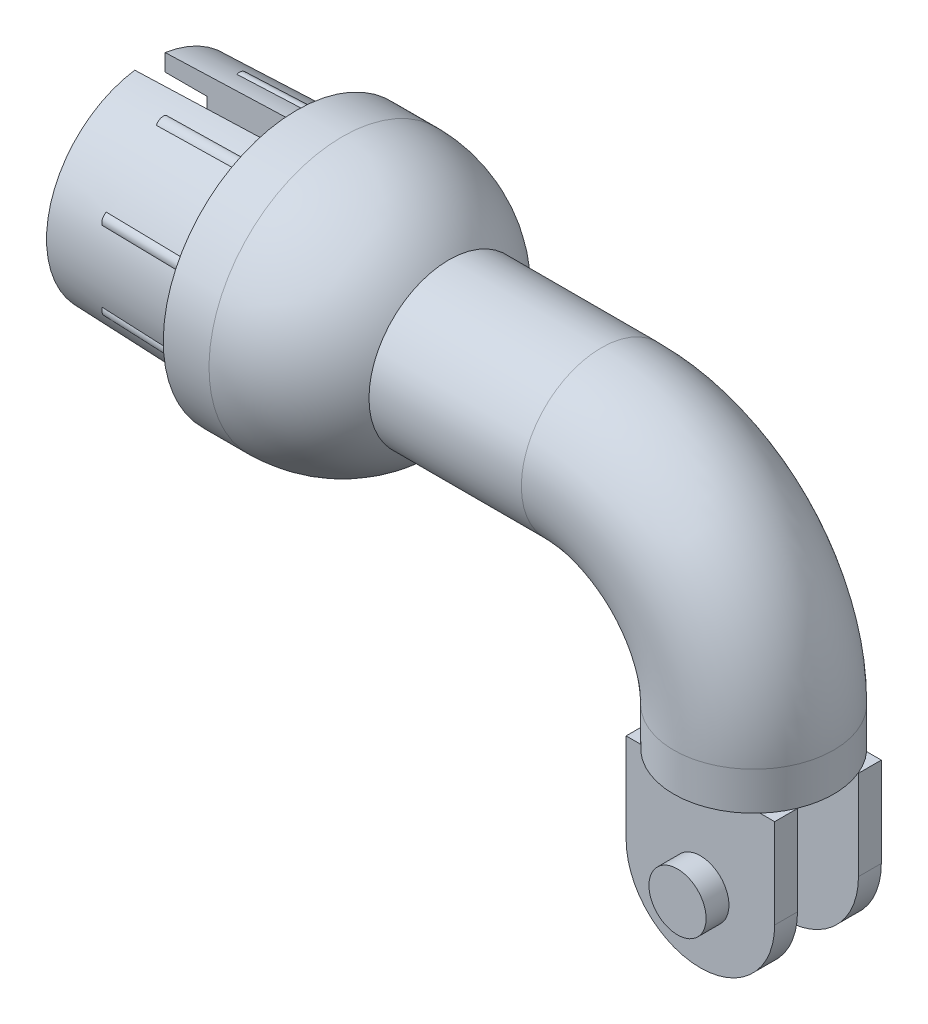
ISO-10303-21;
HEADER;
FILE_DESCRIPTION(('STEP AP214'),'2;1');
FILE_NAME('part.step','',(''),(''),'','','');
FILE_SCHEMA(('AUTOMOTIVE_DESIGN { 1 0 10303 214 1 1 1 1 }'));
ENDSEC;
DATA;
#1=APPLICATION_CONTEXT('core data for automotive mechanical design processes');
#2=APPLICATION_PROTOCOL_DEFINITION('international standard','automotive_design',2000,#1);
#3=PRODUCT_CONTEXT('',#1,'mechanical');
#4=PRODUCT('Part','Part','',(#3));
#5=PRODUCT_RELATED_PRODUCT_CATEGORY('part','',(#4));
#6=PRODUCT_DEFINITION_FORMATION('','',#4);
#7=PRODUCT_DEFINITION_CONTEXT('part definition',#1,'design');
#8=PRODUCT_DEFINITION('design','',#6,#7);
#9=PRODUCT_DEFINITION_SHAPE('','',#8);
#10=(LENGTH_UNIT() NAMED_UNIT(*) SI_UNIT(.MILLI.,.METRE.));
#11=(NAMED_UNIT(*) PLANE_ANGLE_UNIT() SI_UNIT($,.RADIAN.));
#12=(NAMED_UNIT(*) SI_UNIT($,.STERADIAN.) SOLID_ANGLE_UNIT());
#13=UNCERTAINTY_MEASURE_WITH_UNIT(LENGTH_MEASURE(1.E-05),#10,'distance_accuracy_value','');
#14=(GEOMETRIC_REPRESENTATION_CONTEXT(3) GLOBAL_UNCERTAINTY_ASSIGNED_CONTEXT((#13)) GLOBAL_UNIT_ASSIGNED_CONTEXT((#10,
#11,#12)) REPRESENTATION_CONTEXT('',''));
#15=CARTESIAN_POINT('',(0.,0.,0.));
#16=DIRECTION('',(0.,0.,1.));
#17=DIRECTION('',(1.,0.,0.));
#18=AXIS2_PLACEMENT_3D('',#15,#16,#17);
#19=CARTESIAN_POINT('',(0.,6.35,0.));
#20=DIRECTION('',(0.,1.,0.));
#21=DIRECTION('',(0.,0.,1.));
#22=AXIS2_PLACEMENT_3D('',#19,#20,#21);
#23=PLANE('',#22);
#24=CARTESIAN_POINT('',(0.,6.35,0.));
#25=DIRECTION('',(0.,1.,0.));
#26=DIRECTION('',(0.,0.,1.));
#27=AXIS2_PLACEMENT_3D('',#24,#25,#26);
#28=CIRCLE('',#27,5.334);
#29=CARTESIAN_POINT('',(4.93178791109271,6.35,2.03199999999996));
#30=VERTEX_POINT('',#29);
#31=CARTESIAN_POINT('',(4.93178791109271,6.35,-2.03199999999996));
#32=VERTEX_POINT('',#31);
#33=EDGE_CURVE('E44',#30,#32,#28,.T.);
#34=ORIENTED_EDGE('',*,*,#33,.F.);
#35=DIRECTION('',(1.,0.,0.));
#36=VECTOR('',#35,1.);
#37=CARTESIAN_POINT('',(-4.953,6.34999999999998,2.03199999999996));
#38=LINE('',#37,#36);
#39=CARTESIAN_POINT('',(2.60272549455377,6.34999999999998,2.03199999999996));
#40=VERTEX_POINT('',#39);
#41=EDGE_CURVE('E928',#40,#30,#38,.T.);
#42=ORIENTED_EDGE('',*,*,#41,.F.);
#43=CARTESIAN_POINT('',(0.,6.35,0.));
#44=DIRECTION('',(0.,1.,0.));
#45=DIRECTION('',(0.,0.,1.));
#46=AXIS2_PLACEMENT_3D('',#43,#44,#45);
#47=CIRCLE('',#46,3.302);
#48=CARTESIAN_POINT('',(2.60272549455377,6.34999999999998,-2.03199999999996));
#49=VERTEX_POINT('',#48);
#50=EDGE_CURVE('E767',#40,#49,#47,.T.);
#51=ORIENTED_EDGE('',*,*,#50,.T.);
#52=DIRECTION('',(1.,0.,0.));
#53=VECTOR('',#52,1.);
#54=CARTESIAN_POINT('',(-4.953,6.34999999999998,-2.03199999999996));
#55=LINE('',#54,#53);
#56=EDGE_CURVE('E383',#49,#32,#55,.T.);
#57=ORIENTED_EDGE('',*,*,#56,.T.);
#58=EDGE_LOOP('',(#34,#42,#51,#57));
#59=FACE_BOUND('',#58,.T.);
#60=ADVANCED_FACE('F29',(#59),#23,.F.);
#61=DIRECTION('',(1.,0.,0.));
#62=VECTOR('',#61,1.);
#63=CARTESIAN_POINT('',(-4.953,6.34999999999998,3.55599999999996));
#64=LINE('',#63,#62);
#65=CARTESIAN_POINT('',(-3.97572886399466,6.35,3.55599999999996));
#66=VERTEX_POINT('',#65);
#67=CARTESIAN_POINT('',(3.97572886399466,6.35,3.55599999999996));
#68=VERTEX_POINT('',#67);
#69=EDGE_CURVE('E51',#66,#68,#64,.T.);
#70=ORIENTED_EDGE('',*,*,#69,.T.);
#71=EDGE_CURVE('E914',#66,#68,#28,.T.);
#72=ORIENTED_EDGE('',*,*,#71,.F.);
#73=EDGE_LOOP('',(#70,#72));
#74=FACE_BOUND('',#73,.T.);
#75=ADVANCED_FACE('F951',(#74),#23,.F.);
#76=CARTESIAN_POINT('',(0.,0.380999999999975,-3.55599999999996));
#77=DIRECTION('',(0.,0.,1.));
#78=DIRECTION('',(1.,0.,0.));
#79=AXIS2_PLACEMENT_3D('',#76,#77,#78);
#80=PLANE('',#79);
#81=DIRECTION('',(0.,-1.,0.));
#82=VECTOR('',#81,1.);
#83=CARTESIAN_POINT('',(-4.953,6.34999999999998,-3.55599999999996));
#84=LINE('',#83,#82);
#85=CARTESIAN_POINT('',(-4.953,6.34999999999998,-3.55599999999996));
#86=VERTEX_POINT('',#85);
#87=CARTESIAN_POINT('',(-4.953,0.380999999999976,-3.55599999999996));
#88=VERTEX_POINT('',#87);
#89=EDGE_CURVE('E357',#86,#88,#84,.T.);
#90=ORIENTED_EDGE('',*,*,#89,.F.);
#91=DIRECTION('',(1.,0.,0.));
#92=VECTOR('',#91,1.);
#93=CARTESIAN_POINT('',(-4.953,6.34999999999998,-3.55599999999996));
#94=LINE('',#93,#92);
#95=CARTESIAN_POINT('',(-3.97572886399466,6.34999999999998,-3.55599999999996));
#96=VERTEX_POINT('',#95);
#97=EDGE_CURVE('E366',#86,#96,#94,.T.);
#98=ORIENTED_EDGE('',*,*,#97,.T.);
#99=CARTESIAN_POINT('',(3.97572886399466,6.34999999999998,-3.55599999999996));
#100=VERTEX_POINT('',#99);
#101=EDGE_CURVE('E37',#96,#100,#94,.T.);
#102=ORIENTED_EDGE('',*,*,#101,.T.);
#103=CARTESIAN_POINT('',(4.95299999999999,6.34999999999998,-3.55599999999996));
#104=VERTEX_POINT('',#103);
#105=EDGE_CURVE('E365',#100,#104,#94,.T.);
#106=ORIENTED_EDGE('',*,*,#105,.T.);
#107=DIRECTION('',(0.,1.,0.));
#108=VECTOR('',#107,1.);
#109=CARTESIAN_POINT('',(4.953,0.380999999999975,-3.55599999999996));
#110=LINE('',#109,#108);
#111=CARTESIAN_POINT('',(4.953,0.380999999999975,-3.55599999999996));
#112=VERTEX_POINT('',#111);
#113=EDGE_CURVE('E362',#112,#104,#110,.T.);
#114=ORIENTED_EDGE('',*,*,#113,.F.);
#115=CARTESIAN_POINT('',(0.,0.380999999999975,-3.55599999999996));
#116=DIRECTION('',(0.,0.,1.));
#117=DIRECTION('',(1.,0.,0.));
#118=AXIS2_PLACEMENT_3D('',#115,#116,#117);
#119=CIRCLE('',#118,4.953);
#120=EDGE_CURVE('E360',#88,#112,#119,.T.);
#121=ORIENTED_EDGE('',*,*,#120,.F.);
#122=EDGE_LOOP('',(#90,#98,#102,#106,#114,#121));
#123=FACE_BOUND('',#122,.T.);
#124=CARTESIAN_POINT('',(0.,0.,-3.55599999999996));
#125=DIRECTION('',(0.,0.,1.));
#126=DIRECTION('',(1.,0.,0.));
#127=AXIS2_PLACEMENT_3D('',#124,#125,#126);
#128=CIRCLE('',#127,1.905);
#129=CARTESIAN_POINT('',(0.,-1.905,-3.55599999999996));
#130=VERTEX_POINT('',#129);
#131=EDGE_CURVE('E11',#130,#130,#128,.F.);
#132=ORIENTED_EDGE('',*,*,#131,.F.);
#133=EDGE_LOOP('',(#132));
#134=FACE_BOUND('',#133,.T.);
#135=ADVANCED_FACE('F900',(#123,#134),#80,.F.);
#136=ORIENTED_EDGE('',*,*,#101,.F.);
#137=EDGE_CURVE('E799',#100,#96,#28,.T.);
#138=ORIENTED_EDGE('',*,*,#137,.F.);
#139=EDGE_LOOP('',(#136,#138));
#140=FACE_BOUND('',#139,.T.);
#141=ADVANCED_FACE('F907',(#140),#23,.F.);
#142=CARTESIAN_POINT('',(-40.259,19.05,0.));
#143=DIRECTION('',(-1.,0.,0.));
#144=DIRECTION('',(0.,-1.,0.));
#145=AXIS2_PLACEMENT_3D('',#142,#143,#144);
#146=PLANE('',#145);
#147=DIRECTION('',(0.,-1.,0.));
#148=VECTOR('',#147,1.);
#149=CARTESIAN_POINT('',(-40.259,27.94,1.016));
#150=LINE('',#149,#148);
#151=CARTESIAN_POINT('',(-40.259,13.3615198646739,1.016));
#152=VERTEX_POINT('',#151);
#153=CARTESIAN_POINT('',(-40.259,12.2277287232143,1.016));
#154=VERTEX_POINT('',#153);
#155=EDGE_CURVE('E405',#152,#154,#150,.T.);
#156=ORIENTED_EDGE('',*,*,#155,.T.);
#157=CARTESIAN_POINT('',(-40.259,19.05,0.));
#158=DIRECTION('',(-1.,0.,0.));
#159=DIRECTION('',(0.,-1.,0.));
#160=AXIS2_PLACEMENT_3D('',#157,#158,#159);
#161=CIRCLE('',#160,6.8975097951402);
#162=CARTESIAN_POINT('',(-40.259,25.8722712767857,1.016));
#163=VERTEX_POINT('',#162);
#164=EDGE_CURVE('E786',#154,#163,#161,.T.);
#165=ORIENTED_EDGE('',*,*,#164,.T.);
#166=CARTESIAN_POINT('',(-40.259,24.7384801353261,1.016));
#167=VERTEX_POINT('',#166);
#168=EDGE_CURVE('E408',#163,#167,#150,.T.);
#169=ORIENTED_EDGE('',*,*,#168,.T.);
#170=CARTESIAN_POINT('',(-40.259,19.05,0.));
#171=DIRECTION('',(-1.,0.,0.));
#172=DIRECTION('',(0.,-1.,0.));
#173=AXIS2_PLACEMENT_3D('',#170,#171,#172);
#174=CIRCLE('',#173,5.7785);
#175=EDGE_CURVE('E642',#152,#167,#174,.T.);
#176=ORIENTED_EDGE('',*,*,#175,.F.);
#177=EDGE_LOOP('',(#156,#165,#169,#176));
#178=FACE_BOUND('',#177,.T.);
#179=ADVANCED_FACE('F971',(#178),#146,.T.);
#180=CARTESIAN_POINT('',(-37.465,19.05,0.));
#181=DIRECTION('',(-1.,0.,0.));
#182=DIRECTION('',(0.,-1.,0.));
#183=AXIS2_PLACEMENT_3D('',#180,#181,#182);
#184=CYLINDRICAL_SURFACE('',#183,5.7785);
#185=ORIENTED_EDGE('',*,*,#175,.T.);
#186=DIRECTION('',(-1.,0.,0.));
#187=VECTOR('',#186,1.);
#188=CARTESIAN_POINT('',(-37.465,24.7384801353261,1.016));
#189=LINE('',#188,#187);
#190=CARTESIAN_POINT('',(-37.465,24.7384801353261,1.016));
#191=VERTEX_POINT('',#190);
#192=EDGE_CURVE('E616',#167,#191,#189,.F.);
#193=ORIENTED_EDGE('',*,*,#192,.T.);
#194=CARTESIAN_POINT('',(-37.465,19.05,0.));
#195=DIRECTION('',(-1.,0.,0.));
#196=DIRECTION('',(0.,-1.,0.));
#197=AXIS2_PLACEMENT_3D('',#194,#195,#196);
#198=CIRCLE('',#197,5.7785);
#199=CARTESIAN_POINT('',(-37.465,13.3615198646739,1.016));
#200=VERTEX_POINT('',#199);
#201=EDGE_CURVE('E645',#200,#191,#198,.T.);
#202=ORIENTED_EDGE('',*,*,#201,.F.);
#203=DIRECTION('',(-1.,0.,0.));
#204=VECTOR('',#203,1.);
#205=CARTESIAN_POINT('',(-37.465,13.3615198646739,1.016));
#206=LINE('',#205,#204);
#207=EDGE_CURVE('E615',#200,#152,#206,.T.);
#208=ORIENTED_EDGE('',*,*,#207,.T.);
#209=EDGE_LOOP('',(#185,#193,#202,#208));
#210=FACE_BOUND('',#209,.T.);
#211=ADVANCED_FACE('F977',(#210),#184,.F.);
#212=CARTESIAN_POINT('',(-37.465,19.05,0.));
#213=DIRECTION('',(-1.,0.,0.));
#214=DIRECTION('',(0.,-1.,0.));
#215=AXIS2_PLACEMENT_3D('',#212,#213,#214);
#216=PLANE('',#215);
#217=DIRECTION('',(0.,1.,0.));
#218=VECTOR('',#217,1.);
#219=CARTESIAN_POINT('',(-37.465,19.05,1.016));
#220=LINE('',#219,#218);
#221=CARTESIAN_POINT('',(-37.465,14.1932934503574,1.016));
#222=VERTEX_POINT('',#221);
#223=EDGE_CURVE('E626',#200,#222,#220,.T.);
#224=ORIENTED_EDGE('',*,*,#223,.F.);
#225=ORIENTED_EDGE('',*,*,#201,.T.);
#226=CARTESIAN_POINT('',(-37.465,23.9067065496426,1.016));
#227=VERTEX_POINT('',#226);
#228=EDGE_CURVE('E869',#227,#191,#220,.T.);
#229=ORIENTED_EDGE('',*,*,#228,.F.);
#230=CARTESIAN_POINT('',(-37.465,19.05,0.));
#231=DIRECTION('',(-1.,0.,0.));
#232=DIRECTION('',(0.,-1.,0.));
#233=AXIS2_PLACEMENT_3D('',#230,#231,#232);
#234=CIRCLE('',#233,4.96183983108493);
#235=EDGE_CURVE('E652',#222,#227,#234,.T.);
#236=ORIENTED_EDGE('',*,*,#235,.F.);
#237=EDGE_LOOP('',(#224,#225,#229,#236));
#238=FACE_BOUND('',#237,.T.);
#239=ADVANCED_FACE('F1033',(#238),#216,.T.);
#240=CARTESIAN_POINT('',(-30.4090842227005,19.05,0.));
#241=DIRECTION('',(1.,0.,0.));
#242=DIRECTION('',(0.,-1.,0.));
#243=AXIS2_PLACEMENT_3D('',#240,#241,#242);
#244=CONICAL_SURFACE('',#243,5.20823783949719,0.0349065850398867);
#245=CARTESIAN_POINT('',(-45.5995649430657,14.483894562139,1.016));
#246=CARTESIAN_POINT('',(-42.3703496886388,14.3683953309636,1.016));
#247=CARTESIAN_POINT('',(-39.1411284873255,14.2530628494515,1.016));
#248=CARTESIAN_POINT('',(-32.6826741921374,14.0227313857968,1.016));
#249=CARTESIAN_POINT('',(-29.4534410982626,13.9077324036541,1.016));
#250=CARTESIAN_POINT('',(-26.2242020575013,13.7929001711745,1.016));
#251=B_SPLINE_CURVE_WITH_KNOTS('',3,(#245,#246,#247,#248,#249,#250),.UNSPECIFIED.,.F.,.F.,(4,2,
4),(0.,9.69384032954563,19.3876806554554),.UNSPECIFIED.);
#252=CARTESIAN_POINT('',(-31.115,13.9669580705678,1.016));
#253=VERTEX_POINT('',#252);
#254=EDGE_CURVE('E591',#222,#253,#251,.T.);
#255=ORIENTED_EDGE('',*,*,#254,.F.);
#256=ORIENTED_EDGE('',*,*,#235,.T.);
#257=CARTESIAN_POINT('',(-26.2242020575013,24.3070998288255,1.016));
#258=CARTESIAN_POINT('',(-29.4534410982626,24.1922675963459,1.016));
#259=CARTESIAN_POINT('',(-32.6826741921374,24.0772686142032,1.016));
#260=CARTESIAN_POINT('',(-39.1411284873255,23.8469371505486,1.016));
#261=CARTESIAN_POINT('',(-42.3703496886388,23.7316046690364,1.016));
#262=CARTESIAN_POINT('',(-45.5995649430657,23.616105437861,1.016));
#263=B_SPLINE_CURVE_WITH_KNOTS('',3,(#257,#258,#259,#260,#261,#262),.UNSPECIFIED.,.F.,.F.,(4,2,
4),(0.,9.69384032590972,19.3876806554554),.UNSPECIFIED.);
#264=CARTESIAN_POINT('',(-31.115,24.1330419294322,1.016));
#265=VERTEX_POINT('',#264);
#266=EDGE_CURVE('E610',#265,#227,#263,.T.);
#267=ORIENTED_EDGE('',*,*,#266,.F.);
#268=CARTESIAN_POINT('',(-31.115,19.05,0.));
#269=DIRECTION('',(1.,0.,0.));
#270=DIRECTION('',(0.,0.,-1.));
#271=AXIS2_PLACEMENT_3D('',#268,#269,#270);
#272=CIRCLE('',#271,5.18358671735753);
#273=CARTESIAN_POINT('',(-31.115,24.1330419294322,-1.016));
#274=VERTEX_POINT('',#273);
#275=EDGE_CURVE('E639',#274,#265,#272,.T.);
#276=ORIENTED_EDGE('',*,*,#275,.F.);
#277=CARTESIAN_POINT('',(-45.5995649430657,23.616105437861,-1.016));
#278=CARTESIAN_POINT('',(-42.3703496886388,23.7316046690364,-1.016));
#279=CARTESIAN_POINT('',(-39.1411284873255,23.8469371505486,-1.016));
#280=CARTESIAN_POINT('',(-32.6826741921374,24.0772686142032,-1.016));
#281=CARTESIAN_POINT('',(-29.4534410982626,24.1922675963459,-1.016));
#282=CARTESIAN_POINT('',(-26.2242020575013,24.3070998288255,-1.016));
#283=B_SPLINE_CURVE_WITH_KNOTS('',3,(#277,#278,#279,#280,#281,#282),.UNSPECIFIED.,.F.,.F.,(4,2,
4),(0.,9.69384032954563,19.3876806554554),.UNSPECIFIED.);
#284=CARTESIAN_POINT('',(-37.465,23.9067065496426,-1.016));
#285=VERTEX_POINT('',#284);
#286=EDGE_CURVE('E442',#285,#274,#283,.T.);
#287=ORIENTED_EDGE('',*,*,#286,.F.);
#288=CARTESIAN_POINT('',(-37.465,14.1932934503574,-1.016));
#289=VERTEX_POINT('',#288);
#290=EDGE_CURVE('E648',#285,#289,#234,.T.);
#291=ORIENTED_EDGE('',*,*,#290,.T.);
#292=CARTESIAN_POINT('',(-26.2242020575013,13.7929001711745,-1.016));
#293=CARTESIAN_POINT('',(-29.4534410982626,13.9077324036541,-1.016));
#294=CARTESIAN_POINT('',(-32.6826741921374,14.0227313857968,-1.016));
#295=CARTESIAN_POINT('',(-39.1411284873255,14.2530628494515,-1.016));
#296=CARTESIAN_POINT('',(-42.3703496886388,14.3683953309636,-1.016));
#297=CARTESIAN_POINT('',(-45.5995649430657,14.483894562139,-1.016));
#298=B_SPLINE_CURVE_WITH_KNOTS('',3,(#292,#293,#294,#295,#296,#297),.UNSPECIFIED.,.F.,.F.,(4,2,
4),(0.,9.69384032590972,19.3876806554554),.UNSPECIFIED.);
#299=CARTESIAN_POINT('',(-31.115,13.9669580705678,-1.016));
#300=VERTEX_POINT('',#299);
#301=EDGE_CURVE('E412',#300,#289,#298,.T.);
#302=ORIENTED_EDGE('',*,*,#301,.F.);
#303=EDGE_CURVE('E632',#253,#300,#272,.T.);
#304=ORIENTED_EDGE('',*,*,#303,.F.);
#305=EDGE_LOOP('',(#255,#256,#267,#276,#287,#291,#302,#304));
#306=FACE_BOUND('',#305,.T.);
#307=CARTESIAN_POINT('',(-28.448,19.05,0.));
#308=DIRECTION('',(-1.,0.,0.));
#309=DIRECTION('',(0.,-1.,0.));
#310=AXIS2_PLACEMENT_3D('',#307,#308,#309);
#311=CIRCLE('',#310,5.27672040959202);
#312=CARTESIAN_POINT('',(-28.448,13.773279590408,0.));
#313=VERTEX_POINT('',#312);
#314=EDGE_CURVE('E758',#313,#313,#311,.T.);
#315=ORIENTED_EDGE('',*,*,#314,.F.);
#316=EDGE_LOOP('',(#315));
#317=FACE_BOUND('',#316,.T.);
#318=ADVANCED_FACE('F421',(#306,#317),#244,.F.);
#319=CARTESIAN_POINT('',(-30.48,27.94,0.));
#320=DIRECTION('',(-1.,0.,0.));
#321=DIRECTION('',(0.,-1.,0.));
#322=AXIS2_PLACEMENT_3D('',#319,#320,#321);
#323=PLANE('',#322);
#324=CARTESIAN_POINT('',(-30.48,19.05,0.));
#325=DIRECTION('',(1.,0.,0.));
#326=DIRECTION('',(0.,1.,0.));
#327=AXIS2_PLACEMENT_3D('',#324,#325,#326);
#328=CIRCLE('',#327,8.89);
#329=CARTESIAN_POINT('',(-30.48,27.94,0.));
#330=VERTEX_POINT('',#329);
#331=EDGE_CURVE('E789',#330,#330,#328,.T.);
#332=ORIENTED_EDGE('',*,*,#331,.F.);
#333=EDGE_LOOP('',(#332));
#334=FACE_BOUND('',#333,.T.);
#335=CARTESIAN_POINT('',(-30.48,19.05,0.));
#336=DIRECTION('',(-1.,0.,0.));
#337=DIRECTION('',(0.,-1.,0.));
#338=AXIS2_PLACEMENT_3D('',#335,#336,#337);
#339=CIRCLE('',#338,7.239);
#340=CARTESIAN_POINT('',(-30.48,25.8624306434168,2.44824625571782));
#341=VERTEX_POINT('',#340);
#342=CARTESIAN_POINT('',(-30.48,25.8624306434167,-2.44824625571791));
#343=VERTEX_POINT('',#342);
#344=EDGE_CURVE('E771',#341,#343,#339,.T.);
#345=ORIENTED_EDGE('',*,*,#344,.F.);
#346=CARTESIAN_POINT('',(-30.48,25.3859658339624,2.62444297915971));
#347=DIRECTION('',(-1.,0.,0.));
#348=DIRECTION('',(0.,-0.707106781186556,-0.707106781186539));
#349=AXIS2_PLACEMENT_3D('',#346,#347,#348);
#350=CIRCLE('',#349,0.508000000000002);
#351=CARTESIAN_POINT('',(-30.48,25.5982874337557,3.08594437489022));
#352=VERTEX_POINT('',#351);
#353=EDGE_CURVE('E649',#352,#341,#350,.T.);
#354=ORIENTED_EDGE('',*,*,#353,.F.);
#355=CARTESIAN_POINT('',(-30.48,22.1359443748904,6.54828743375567));
#356=VERTEX_POINT('',#355);
#357=EDGE_CURVE('E1378',#356,#352,#339,.T.);
#358=ORIENTED_EDGE('',*,*,#357,.F.);
#359=CARTESIAN_POINT('',(-30.48,21.6744429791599,6.33596583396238));
#360=DIRECTION('',(-1.,0.,0.));
#361=DIRECTION('',(0.,0.,-1.));
#362=AXIS2_PLACEMENT_3D('',#359,#360,#361);
#363=CIRCLE('',#362,0.508000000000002);
#364=CARTESIAN_POINT('',(-30.48,21.498246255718,6.8124306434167));
#365=VERTEX_POINT('',#364);
#366=EDGE_CURVE('E655',#365,#356,#363,.T.);
#367=ORIENTED_EDGE('',*,*,#366,.F.);
#368=CARTESIAN_POINT('',(-30.48,16.6017537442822,6.81243064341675));
#369=VERTEX_POINT('',#368);
#370=EDGE_CURVE('E1379',#369,#365,#339,.T.);
#371=ORIENTED_EDGE('',*,*,#370,.F.);
#372=CARTESIAN_POINT('',(-30.48,16.4255570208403,6.33596583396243));
#373=DIRECTION('',(-1.,0.,0.));
#374=DIRECTION('',(0.,0.707106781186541,-0.707106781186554));
#375=AXIS2_PLACEMENT_3D('',#372,#373,#374);
#376=CIRCLE('',#375,0.508000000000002);
#377=CARTESIAN_POINT('',(-30.48,15.9640556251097,6.54828743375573));
#378=VERTEX_POINT('',#377);
#379=EDGE_CURVE('E678',#378,#369,#376,.T.);
#380=ORIENTED_EDGE('',*,*,#379,.F.);
#381=CARTESIAN_POINT('',(-30.48,12.5017125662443,3.08594437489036));
#382=VERTEX_POINT('',#381);
#383=EDGE_CURVE('E1381',#382,#378,#339,.T.);
#384=ORIENTED_EDGE('',*,*,#383,.F.);
#385=CARTESIAN_POINT('',(-30.48,12.7140341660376,2.62444297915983));
#386=DIRECTION('',(-1.,0.,0.));
#387=DIRECTION('',(0.,1.,0.));
#388=AXIS2_PLACEMENT_3D('',#385,#386,#387);
#389=CIRCLE('',#388,0.508000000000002);
#390=CARTESIAN_POINT('',(-30.48,12.2375693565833,2.44824625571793));
#391=VERTEX_POINT('',#390);
#392=EDGE_CURVE('E683',#391,#382,#389,.T.);
#393=ORIENTED_EDGE('',*,*,#392,.F.);
#394=CARTESIAN_POINT('',(-30.48,12.2375693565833,-2.44824625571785));
#395=VERTEX_POINT('',#394);
#396=EDGE_CURVE('E1384',#395,#391,#339,.T.);
#397=ORIENTED_EDGE('',*,*,#396,.F.);
#398=CARTESIAN_POINT('',(-30.48,12.7140341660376,-2.62444297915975));
#399=DIRECTION('',(-1.,0.,0.));
#400=DIRECTION('',(0.,0.707106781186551,0.707106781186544));
#401=AXIS2_PLACEMENT_3D('',#398,#399,#400);
#402=CIRCLE('',#401,0.508000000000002);
#403=CARTESIAN_POINT('',(-30.48,12.5017125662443,-3.08594437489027));
#404=VERTEX_POINT('',#403);
#405=EDGE_CURVE('E704',#404,#395,#402,.T.);
#406=ORIENTED_EDGE('',*,*,#405,.F.);
#407=CARTESIAN_POINT('',(-30.48,15.9640556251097,-6.54828743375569));
#408=VERTEX_POINT('',#407);
#409=EDGE_CURVE('E1387',#408,#404,#339,.T.);
#410=ORIENTED_EDGE('',*,*,#409,.F.);
#411=CARTESIAN_POINT('',(-30.48,16.4255570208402,-6.33596583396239));
#412=DIRECTION('',(-1.,0.,0.));
#413=DIRECTION('',(0.,0.,1.));
#414=AXIS2_PLACEMENT_3D('',#411,#412,#413);
#415=CIRCLE('',#414,0.508000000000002);
#416=CARTESIAN_POINT('',(-30.48,16.6017537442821,-6.81243064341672));
#417=VERTEX_POINT('',#416);
#418=EDGE_CURVE('E709',#417,#408,#415,.T.);
#419=ORIENTED_EDGE('',*,*,#418,.F.);
#420=CARTESIAN_POINT('',(-30.48,21.4982462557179,-6.81243064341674));
#421=VERTEX_POINT('',#420);
#422=EDGE_CURVE('E785',#421,#417,#339,.T.);
#423=ORIENTED_EDGE('',*,*,#422,.F.);
#424=CARTESIAN_POINT('',(-30.48,21.6744429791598,-6.33596583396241));
#425=DIRECTION('',(-1.,0.,0.));
#426=DIRECTION('',(0.,-0.707106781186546,0.707106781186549));
#427=AXIS2_PLACEMENT_3D('',#424,#425,#426);
#428=CIRCLE('',#427,0.508000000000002);
#429=CARTESIAN_POINT('',(-30.48,22.1359443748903,-6.54828743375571));
#430=VERTEX_POINT('',#429);
#431=EDGE_CURVE('E730',#430,#421,#428,.T.);
#432=ORIENTED_EDGE('',*,*,#431,.F.);
#433=CARTESIAN_POINT('',(-30.48,25.5982874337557,-3.08594437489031));
#434=VERTEX_POINT('',#433);
#435=EDGE_CURVE('E781',#434,#430,#339,.T.);
#436=ORIENTED_EDGE('',*,*,#435,.F.);
#437=CARTESIAN_POINT('',(-30.48,25.3859658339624,-2.62444297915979));
#438=DIRECTION('',(-1.,0.,0.));
#439=DIRECTION('',(0.,-1.,0.));
#440=AXIS2_PLACEMENT_3D('',#437,#438,#439);
#441=CIRCLE('',#440,0.508000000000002);
#442=EDGE_CURVE('E735',#343,#434,#441,.T.);
#443=ORIENTED_EDGE('',*,*,#442,.F.);
#444=EDGE_LOOP('',(#345,#354,#358,#367,#371,#380,#384,#393,#397,#406,#410,#419,#423,#432,#436,#443));
#445=FACE_BOUND('',#444,.T.);
#446=ADVANCED_FACE('F462',(#334,#445),#323,.T.);
#447=CARTESIAN_POINT('',(-30.48,19.05,0.));
#448=DIRECTION('',(1.,0.,0.));
#449=DIRECTION('',(0.,-1.,0.));
#450=AXIS2_PLACEMENT_3D('',#447,#448,#449);
#451=CONICAL_SURFACE('',#450,7.239,0.0349065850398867);
#452=ORIENTED_EDGE('',*,*,#164,.F.);
#453=CARTESIAN_POINT('',(-51.4974364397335,12.624777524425,1.016));
#454=CARTESIAN_POINT('',(-47.0067210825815,12.4660270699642,1.016));
#455=CARTESIAN_POINT('',(-42.5160016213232,12.3073928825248,1.016));
#456=CARTESIAN_POINT('',(-33.534554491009,11.9903570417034,1.016));
#457=CARTESIAN_POINT('',(-29.0438268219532,11.8319553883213,1.016));
#458=CARTESIAN_POINT('',(-24.5530950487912,11.6736700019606,1.01600000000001));
#459=B_SPLINE_CURVE_WITH_KNOTS('',3,(#453,#454,#455,#456,#457,#458),.UNSPECIFIED.,.F.,.F.,(4,2,
4),(0.,13.4805613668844,26.9611227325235),.UNSPECIFIED.);
#460=CARTESIAN_POINT('',(-31.115,11.9050499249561,1.016));
#461=VERTEX_POINT('',#460);
#462=EDGE_CURVE('E590',#154,#461,#459,.T.);
#463=ORIENTED_EDGE('',*,*,#462,.T.);
#464=CARTESIAN_POINT('',(-31.115,19.05,0.));
#465=DIRECTION('',(1.,0.,0.));
#466=DIRECTION('',(0.,0.,-1.));
#467=AXIS2_PLACEMENT_3D('',#464,#465,#466);
#468=CIRCLE('',#467,7.21682531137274);
#469=CARTESIAN_POINT('',(-31.115,11.9050499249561,-1.016));
#470=VERTEX_POINT('',#469);
#471=EDGE_CURVE('E635',#461,#470,#468,.T.);
#472=ORIENTED_EDGE('',*,*,#471,.T.);
#473=CARTESIAN_POINT('',(-24.5530950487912,11.6736700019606,-1.016));
#474=CARTESIAN_POINT('',(-29.0438268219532,11.8319553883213,-1.016));
#475=CARTESIAN_POINT('',(-33.534554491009,11.9903570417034,-1.016));
#476=CARTESIAN_POINT('',(-42.5160016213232,12.3073928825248,-1.016));
#477=CARTESIAN_POINT('',(-47.0067210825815,12.4660270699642,-1.016));
#478=CARTESIAN_POINT('',(-51.4974364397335,12.624777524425,-1.016));
#479=B_SPLINE_CURVE_WITH_KNOTS('',3,(#473,#474,#475,#476,#477,#478),.UNSPECIFIED.,.F.,.F.,(4,2,
4),(0.,13.4805613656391,26.9611227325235),.UNSPECIFIED.);
#480=CARTESIAN_POINT('',(-40.259,12.2277287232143,-1.016));
#481=VERTEX_POINT('',#480);
#482=EDGE_CURVE('E453',#470,#481,#479,.T.);
#483=ORIENTED_EDGE('',*,*,#482,.T.);
#484=CARTESIAN_POINT('',(-40.259,25.8722712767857,-1.016));
#485=VERTEX_POINT('',#484);
#486=EDGE_CURVE('E784',#485,#481,#161,.T.);
#487=ORIENTED_EDGE('',*,*,#486,.F.);
#488=CARTESIAN_POINT('',(-51.4974364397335,25.4752224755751,-1.016));
#489=CARTESIAN_POINT('',(-47.0067210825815,25.6339729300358,-1.016));
#490=CARTESIAN_POINT('',(-42.5160016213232,25.7926071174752,-1.016));
#491=CARTESIAN_POINT('',(-33.534554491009,26.1096429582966,-1.016));
#492=CARTESIAN_POINT('',(-29.0438268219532,26.2680446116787,-1.016));
#493=CARTESIAN_POINT('',(-24.5530950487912,26.4263299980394,-1.016));
#494=B_SPLINE_CURVE_WITH_KNOTS('',3,(#488,#489,#490,#491,#492,#493),.UNSPECIFIED.,.F.,.F.,(4,2,
4),(0.,13.4805613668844,26.9611227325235),.UNSPECIFIED.);
#495=CARTESIAN_POINT('',(-31.115,26.1949500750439,-1.016));
#496=VERTEX_POINT('',#495);
#497=EDGE_CURVE('E447',#485,#496,#494,.T.);
#498=ORIENTED_EDGE('',*,*,#497,.T.);
#499=CARTESIAN_POINT('',(-31.115,26.1949500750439,1.016));
#500=VERTEX_POINT('',#499);
#501=EDGE_CURVE('E871',#496,#500,#468,.T.);
#502=ORIENTED_EDGE('',*,*,#501,.T.);
#503=CARTESIAN_POINT('',(-24.5530950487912,26.4263299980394,1.01600000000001));
#504=CARTESIAN_POINT('',(-29.0438268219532,26.2680446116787,1.016));
#505=CARTESIAN_POINT('',(-33.534554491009,26.1096429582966,1.016));
#506=CARTESIAN_POINT('',(-42.5160016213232,25.7926071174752,1.016));
#507=CARTESIAN_POINT('',(-47.0067210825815,25.6339729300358,1.016));
#508=CARTESIAN_POINT('',(-51.4974364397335,25.4752224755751,1.016));
#509=B_SPLINE_CURVE_WITH_KNOTS('',3,(#503,#504,#505,#506,#507,#508),.UNSPECIFIED.,.F.,.F.,(4,2,
4),(0.,13.4805613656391,26.9611227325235),.UNSPECIFIED.);
#510=EDGE_CURVE('E584',#500,#163,#509,.T.);
#511=ORIENTED_EDGE('',*,*,#510,.T.);
#512=EDGE_LOOP('',(#452,#463,#472,#483,#487,#498,#502,#511));
#513=FACE_BOUND('',#512,.T.);
#514=CARTESIAN_POINT('',(-30.4799999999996,25.8624306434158,2.44824625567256));
#515=CARTESIAN_POINT('',(-30.8180476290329,25.8515171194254,2.44370916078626));
#516=CARTESIAN_POINT('',(-31.1560952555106,25.8406035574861,2.4391719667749));
#517=CARTESIAN_POINT('',(-32.8463333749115,25.7860355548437,2.41648549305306));
#518=CARTESIAN_POINT('',(-34.1985238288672,25.7423805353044,2.3983347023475));
#519=CARTESIAN_POINT('',(-35.9771428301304,25.6849575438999,2.37445759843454));
#520=CARTESIAN_POINT('',(-36.4035714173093,25.6711901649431,2.36873282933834));
#521=CARTESIAN_POINT('',(-36.83,25.6574227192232,2.36300788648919));
#522=B_SPLINE_CURVE_WITH_KNOTS('',3,(#514,#515,#516,#517,#518,#519,#520,#521),.UNSPECIFIED.,.F.,
.F.,(4,2,2,4),(0.,1.01476253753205,5.07381268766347,6.35388021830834),.UNSPECIFIED.);
#523=CARTESIAN_POINT('',(-36.83,25.6574227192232,2.36300788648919));
#524=VERTEX_POINT('',#523);
#525=EDGE_CURVE('E577',#341,#524,#522,.T.);
#526=ORIENTED_EDGE('',*,*,#525,.F.);
#527=ORIENTED_EDGE('',*,*,#344,.T.);
#528=CARTESIAN_POINT('',(-36.83,25.6574227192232,-2.36300788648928));
#529=CARTESIAN_POINT('',(-36.4919524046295,25.6683367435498,-2.36754628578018));
#530=CARTESIAN_POINT('',(-36.153904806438,25.6792507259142,-2.37208457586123));
#531=CARTESIAN_POINT('',(-34.4636668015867,25.7338204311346,-2.39477548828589));
#532=CARTESIAN_POINT('',(-33.1114763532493,25.7774755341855,-2.41292649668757));
#533=CARTESIAN_POINT('',(-31.3328572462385,25.8348969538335,-2.43679950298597));
#534=CARTESIAN_POINT('',(-30.9064286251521,25.8486638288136,-2.44252295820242));
#535=CARTESIAN_POINT('',(-30.48,25.8624306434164,-2.44824625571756));
#536=B_SPLINE_CURVE_WITH_KNOTS('',3,(#528,#529,#530,#531,#532,#533,#534,#535),.UNSPECIFIED.,.F.,
.F.,(4,2,2,4),(0.,1.01476253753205,5.07381268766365,6.35388021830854),.UNSPECIFIED.);
#537=CARTESIAN_POINT('',(-36.83,25.6574227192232,-2.36300788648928));
#538=VERTEX_POINT('',#537);
#539=EDGE_CURVE('E469',#538,#343,#536,.T.);
#540=ORIENTED_EDGE('',*,*,#539,.F.);
#541=CARTESIAN_POINT('',(-36.83,19.05,0.));
#542=DIRECTION('',(-1.,0.,0.));
#543=DIRECTION('',(0.,-1.,0.));
#544=AXIS2_PLACEMENT_3D('',#541,#542,#543);
#545=CIRCLE('',#544,7.0172531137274);
#546=CARTESIAN_POINT('',(-36.83,25.3930523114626,-3.0012545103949));
#547=VERTEX_POINT('',#546);
#548=EDGE_CURVE('E807',#538,#547,#545,.T.);
#549=ORIENTED_EDGE('',*,*,#548,.T.);
#550=CARTESIAN_POINT('',(-30.48,25.5982874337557,-3.08594437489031));
#551=CARTESIAN_POINT('',(-30.818047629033,25.5873621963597,-3.08143555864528));
#552=CARTESIAN_POINT('',(-31.1560952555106,25.5764368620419,-3.07692678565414));
#553=CARTESIAN_POINT('',(-32.8463333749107,25.5218096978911,-3.05438314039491));
#554=CARTESIAN_POINT('',(-34.1985238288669,25.4781063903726,-3.03634892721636));
#555=CARTESIAN_POINT('',(-35.9771428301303,25.4206185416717,-3.01262840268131));
#556=CARTESIAN_POINT('',(-36.4035714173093,25.4068355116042,-3.00694141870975));
#557=CARTESIAN_POINT('',(-36.83,25.3930523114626,-3.0012545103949));
#558=B_SPLINE_CURVE_WITH_KNOTS('',3,(#550,#551,#552,#553,#554,#555,#556,#557),.UNSPECIFIED.,.F.,
.F.,(4,2,2,4),(0.,1.01476253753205,5.07381268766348,6.35388021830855),.UNSPECIFIED.);
#559=EDGE_CURVE('E479',#434,#547,#558,.T.);
#560=ORIENTED_EDGE('',*,*,#559,.F.);
#561=ORIENTED_EDGE('',*,*,#435,.T.);
#562=CARTESIAN_POINT('',(-36.83,22.0512545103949,-6.34305231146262));
#563=CARTESIAN_POINT('',(-36.4919524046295,22.0557627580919,-6.35397882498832));
#564=CARTESIAN_POINT('',(-36.153904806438,22.0602710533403,-6.36490523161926));
#565=CARTESIAN_POINT('',(-34.4636668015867,22.0828127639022,-6.41953673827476));
#566=CARTESIAN_POINT('',(-33.1114763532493,22.1008468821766,-6.46324025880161));
#567=CARTESIAN_POINT('',(-31.3328572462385,22.1245691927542,-6.52072409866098));
#568=CARTESIAN_POINT('',(-30.9064286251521,22.130256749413,-6.53450584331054));
#569=CARTESIAN_POINT('',(-30.48,22.1359443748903,-6.54828743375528));
#570=B_SPLINE_CURVE_WITH_KNOTS('',3,(#562,#563,#564,#565,#566,#567,#568,#569),.UNSPECIFIED.,.F.,
.F.,(4,2,2,4),(0.,1.01476253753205,5.07381268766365,6.35388021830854),.UNSPECIFIED.);
#571=CARTESIAN_POINT('',(-36.83,22.0512545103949,-6.34305231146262));
#572=VERTEX_POINT('',#571);
#573=EDGE_CURVE('E486',#572,#430,#570,.T.);
#574=ORIENTED_EDGE('',*,*,#573,.F.);
#575=CARTESIAN_POINT('',(-36.83,19.05,0.));
#576=DIRECTION('',(-1.,0.,0.));
#577=DIRECTION('',(0.,-1.,0.));
#578=AXIS2_PLACEMENT_3D('',#575,#576,#577);
#579=CIRCLE('',#578,7.0172531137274);
#580=CARTESIAN_POINT('',(-36.83,21.4130078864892,-6.60742271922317));
#581=VERTEX_POINT('',#580);
#582=EDGE_CURVE('E816',#572,#581,#579,.T.);
#583=ORIENTED_EDGE('',*,*,#582,.T.);
#584=CARTESIAN_POINT('',(-30.48,21.4982462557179,-6.81243064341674));
#585=CARTESIAN_POINT('',(-30.818047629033,21.4937091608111,-6.80151711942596));
#586=CARTESIAN_POINT('',(-31.1560952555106,21.4891719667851,-6.79060355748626));
#587=CARTESIAN_POINT('',(-32.8463333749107,21.4664854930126,-6.73603555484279));
#588=CARTESIAN_POINT('',(-34.1985238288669,21.4483347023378,-6.69238053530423));
#589=CARTESIAN_POINT('',(-35.9771428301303,21.4244575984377,-6.63495754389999));
#590=CARTESIAN_POINT('',(-36.4035714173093,21.4187328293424,-6.62119016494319));
#591=CARTESIAN_POINT('',(-36.83,21.4130078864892,-6.60742271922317));
#592=B_SPLINE_CURVE_WITH_KNOTS('',3,(#584,#585,#586,#587,#588,#589,#590,#591),.UNSPECIFIED.,.F.,
.F.,(4,2,2,4),(0.,1.01476253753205,5.07381268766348,6.35388021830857),.UNSPECIFIED.);
#593=EDGE_CURVE('E493',#421,#581,#592,.T.);
#594=ORIENTED_EDGE('',*,*,#593,.F.);
#595=ORIENTED_EDGE('',*,*,#422,.T.);
#596=CARTESIAN_POINT('',(-36.83,16.6869921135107,-6.60742271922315));
#597=CARTESIAN_POINT('',(-36.4919524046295,16.6824537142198,-6.61833674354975));
#598=CARTESIAN_POINT('',(-36.153904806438,16.6779154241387,-6.62925072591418));
#599=CARTESIAN_POINT('',(-34.4636668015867,16.6552245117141,-6.68382043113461));
#600=CARTESIAN_POINT('',(-33.1114763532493,16.6370735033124,-6.72747553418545));
#601=CARTESIAN_POINT('',(-31.3328572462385,16.613200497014,-6.78489695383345));
#602=CARTESIAN_POINT('',(-30.9064286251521,16.6074770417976,-6.79866382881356));
#603=CARTESIAN_POINT('',(-30.48,16.6017537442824,-6.81243064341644));
#604=B_SPLINE_CURVE_WITH_KNOTS('',3,(#596,#597,#598,#599,#600,#601,#602,#603),.UNSPECIFIED.,.F.,
.F.,(4,2,2,4),(0.,1.01476253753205,5.07381268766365,6.35388021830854),.UNSPECIFIED.);
#605=CARTESIAN_POINT('',(-36.83,16.6869921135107,-6.60742271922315));
#606=VERTEX_POINT('',#605);
#607=EDGE_CURVE('E500',#606,#417,#604,.T.);
#608=ORIENTED_EDGE('',*,*,#607,.F.);
#609=CARTESIAN_POINT('',(-36.83,19.05,0.));
#610=DIRECTION('',(-1.,0.,0.));
#611=DIRECTION('',(0.,-1.,0.));
#612=AXIS2_PLACEMENT_3D('',#609,#610,#611);
#613=CIRCLE('',#612,7.0172531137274);
#614=CARTESIAN_POINT('',(-36.83,16.0487454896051,-6.34305231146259));
#615=VERTEX_POINT('',#614);
#616=EDGE_CURVE('E823',#606,#615,#613,.T.);
#617=ORIENTED_EDGE('',*,*,#616,.T.);
#618=CARTESIAN_POINT('',(-30.48,15.9640556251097,-6.54828743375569));
#619=CARTESIAN_POINT('',(-30.818047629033,15.9685644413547,-6.53736219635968));
#620=CARTESIAN_POINT('',(-31.1560952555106,15.9730732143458,-6.5264368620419));
#621=CARTESIAN_POINT('',(-32.8463333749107,15.9956168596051,-6.47180969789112));
#622=CARTESIAN_POINT('',(-34.1985238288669,16.0136510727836,-6.42810639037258));
#623=CARTESIAN_POINT('',(-35.9771428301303,16.0373715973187,-6.37061854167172));
#624=CARTESIAN_POINT('',(-36.4035714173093,16.0430585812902,-6.35683551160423));
#625=CARTESIAN_POINT('',(-36.83,16.0487454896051,-6.3430523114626));
#626=B_SPLINE_CURVE_WITH_KNOTS('',3,(#618,#619,#620,#621,#622,#623,#624,#625),.UNSPECIFIED.,.F.,
.F.,(4,2,2,4),(0.,1.01476253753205,5.07381268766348,6.35388021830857),.UNSPECIFIED.);
#627=EDGE_CURVE('E507',#408,#615,#626,.T.);
#628=ORIENTED_EDGE('',*,*,#627,.F.);
#629=ORIENTED_EDGE('',*,*,#409,.T.);
#630=CARTESIAN_POINT('',(-36.83,12.7069476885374,-3.00125451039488));
#631=CARTESIAN_POINT('',(-36.4919524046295,12.6960211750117,-3.00576275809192));
#632=CARTESIAN_POINT('',(-36.153904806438,12.6850947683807,-3.01027105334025));
#633=CARTESIAN_POINT('',(-34.4636668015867,12.6304632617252,-3.03281276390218));
#634=CARTESIAN_POINT('',(-33.1114763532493,12.5867597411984,-3.05084688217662));
#635=CARTESIAN_POINT('',(-31.3328572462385,12.529275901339,-3.07456919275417));
#636=CARTESIAN_POINT('',(-30.9064286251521,12.5154941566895,-3.08025674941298));
#637=CARTESIAN_POINT('',(-30.48,12.5017125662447,-3.08594437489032));
#638=B_SPLINE_CURVE_WITH_KNOTS('',3,(#630,#631,#632,#633,#634,#635,#636,#637),.UNSPECIFIED.,.F.,
.F.,(4,2,2,4),(0.,1.01476253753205,5.07381268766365,6.35388021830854),.UNSPECIFIED.);
#639=CARTESIAN_POINT('',(-36.83,12.7069476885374,-3.00125451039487));
#640=VERTEX_POINT('',#639);
#641=EDGE_CURVE('E514',#640,#404,#638,.T.);
#642=ORIENTED_EDGE('',*,*,#641,.F.);
#643=CARTESIAN_POINT('',(-36.83,19.05,0.));
#644=DIRECTION('',(-1.,0.,0.));
#645=DIRECTION('',(0.,-1.,0.));
#646=AXIS2_PLACEMENT_3D('',#643,#644,#645);
#647=CIRCLE('',#646,7.0172531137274);
#648=CARTESIAN_POINT('',(-36.83,12.4425772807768,-2.36300788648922));
#649=VERTEX_POINT('',#648);
#650=EDGE_CURVE('E830',#640,#649,#647,.T.);
#651=ORIENTED_EDGE('',*,*,#650,.T.);
#652=CARTESIAN_POINT('',(-30.4799999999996,12.2375693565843,-2.44824625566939));
#653=CARTESIAN_POINT('',(-30.8180476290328,12.2484828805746,-2.44370916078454));
#654=CARTESIAN_POINT('',(-31.1560952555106,12.259396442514,-2.43917196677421));
#655=CARTESIAN_POINT('',(-32.8463333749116,12.3139644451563,-2.41648549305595));
#656=CARTESIAN_POINT('',(-34.1985238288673,12.3576194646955,-2.39833470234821));
#657=CARTESIAN_POINT('',(-35.9771428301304,12.4150424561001,-2.37445759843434));
#658=CARTESIAN_POINT('',(-36.4035714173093,12.4288098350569,-2.36873282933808));
#659=CARTESIAN_POINT('',(-36.83,12.4425772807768,-2.36300788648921));
#660=B_SPLINE_CURVE_WITH_KNOTS('',3,(#652,#653,#654,#655,#656,#657,#658,#659),.UNSPECIFIED.,.F.,
.F.,(4,2,2,4),(0.,1.01476253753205,5.07381268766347,6.35388021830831),.UNSPECIFIED.);
#661=EDGE_CURVE('E521',#395,#649,#660,.T.);
#662=ORIENTED_EDGE('',*,*,#661,.F.);
#663=ORIENTED_EDGE('',*,*,#396,.T.);
#664=CARTESIAN_POINT('',(-36.83,12.4425772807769,2.3630078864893));
#665=CARTESIAN_POINT('',(-36.4919524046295,12.4316632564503,2.3675462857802));
#666=CARTESIAN_POINT('',(-36.153904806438,12.4207492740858,2.37208457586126));
#667=CARTESIAN_POINT('',(-34.4636668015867,12.3661795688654,2.39477548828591));
#668=CARTESIAN_POINT('',(-33.1114763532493,12.3225244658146,2.4129264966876));
#669=CARTESIAN_POINT('',(-31.3328572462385,12.2651030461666,2.436799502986));
#670=CARTESIAN_POINT('',(-30.9064286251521,12.2513361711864,2.44252295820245));
#671=CARTESIAN_POINT('',(-30.48,12.2375693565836,2.44824625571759));
#672=B_SPLINE_CURVE_WITH_KNOTS('',3,(#664,#665,#666,#667,#668,#669,#670,#671),.UNSPECIFIED.,.F.,
.F.,(4,2,2,4),(0.,1.01476253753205,5.07381268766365,6.35388021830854),.UNSPECIFIED.);
#673=CARTESIAN_POINT('',(-36.83,12.4425772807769,2.3630078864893));
#674=VERTEX_POINT('',#673);
#675=EDGE_CURVE('E528',#674,#391,#672,.T.);
#676=ORIENTED_EDGE('',*,*,#675,.F.);
#677=CARTESIAN_POINT('',(-36.83,19.05,0.));
#678=DIRECTION('',(-1.,0.,0.));
#679=DIRECTION('',(0.,-1.,0.));
#680=AXIS2_PLACEMENT_3D('',#677,#678,#679);
#681=CIRCLE('',#680,7.0172531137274);
#682=CARTESIAN_POINT('',(-36.83,12.7069476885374,3.00125451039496));
#683=VERTEX_POINT('',#682);
#684=EDGE_CURVE('E837',#674,#683,#681,.T.);
#685=ORIENTED_EDGE('',*,*,#684,.T.);
#686=CARTESIAN_POINT('',(-30.48,12.5017125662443,3.08594437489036));
#687=CARTESIAN_POINT('',(-30.818047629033,12.5126378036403,3.08143555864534));
#688=CARTESIAN_POINT('',(-31.1560952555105,12.5235631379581,3.07692678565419));
#689=CARTESIAN_POINT('',(-32.8463333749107,12.5781903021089,3.05438314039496));
#690=CARTESIAN_POINT('',(-34.1985238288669,12.6218936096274,3.03634892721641));
#691=CARTESIAN_POINT('',(-35.9771428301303,12.6793814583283,3.01262840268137));
#692=CARTESIAN_POINT('',(-36.4035714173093,12.6931644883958,3.00694141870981));
#693=CARTESIAN_POINT('',(-36.83,12.7069476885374,3.00125451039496));
#694=B_SPLINE_CURVE_WITH_KNOTS('',3,(#686,#687,#688,#689,#690,#691,#692,#693),.UNSPECIFIED.,.F.,
.F.,(4,2,2,4),(0.,1.01476253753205,5.07381268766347,6.35388021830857),.UNSPECIFIED.);
#695=EDGE_CURVE('E535',#382,#683,#694,.T.);
#696=ORIENTED_EDGE('',*,*,#695,.F.);
#697=ORIENTED_EDGE('',*,*,#383,.T.);
#698=CARTESIAN_POINT('',(-36.83,16.0487454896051,6.34305231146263));
#699=CARTESIAN_POINT('',(-36.4919524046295,16.0442372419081,6.35397882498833));
#700=CARTESIAN_POINT('',(-36.153904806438,16.0397289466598,6.36490523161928));
#701=CARTESIAN_POINT('',(-34.4636668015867,16.0171872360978,6.41953673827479));
#702=CARTESIAN_POINT('',(-33.1114763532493,15.9991531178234,6.46324025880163));
#703=CARTESIAN_POINT('',(-31.3328572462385,15.9754308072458,6.520724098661));
#704=CARTESIAN_POINT('',(-30.9064286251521,15.969743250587,6.53450584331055));
#705=CARTESIAN_POINT('',(-30.4800000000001,15.9640556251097,6.54828743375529));
#706=B_SPLINE_CURVE_WITH_KNOTS('',3,(#698,#699,#700,#701,#702,#703,#704,#705),.UNSPECIFIED.,.F.,
.F.,(4,2,2,4),(0.,1.01476253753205,5.07381268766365,6.35388021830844),.UNSPECIFIED.);
#707=CARTESIAN_POINT('',(-36.83,16.0487454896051,6.34305231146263));
#708=VERTEX_POINT('',#707);
#709=EDGE_CURVE('E542',#708,#378,#706,.T.);
#710=ORIENTED_EDGE('',*,*,#709,.F.);
#711=CARTESIAN_POINT('',(-36.83,19.05,0.));
#712=DIRECTION('',(-1.,0.,0.));
#713=DIRECTION('',(0.,-1.,0.));
#714=AXIS2_PLACEMENT_3D('',#711,#712,#713);
#715=CIRCLE('',#714,7.0172531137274);
#716=CARTESIAN_POINT('',(-36.83,16.6869921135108,6.60742271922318));
#717=VERTEX_POINT('',#716);
#718=EDGE_CURVE('E844',#708,#717,#715,.T.);
#719=ORIENTED_EDGE('',*,*,#718,.T.);
#720=CARTESIAN_POINT('',(-30.48,16.6017537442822,6.81243064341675));
#721=CARTESIAN_POINT('',(-30.818047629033,16.606290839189,6.80151711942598));
#722=CARTESIAN_POINT('',(-31.1560952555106,16.6108280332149,6.79060355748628));
#723=CARTESIAN_POINT('',(-32.8463333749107,16.6335145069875,6.7360355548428));
#724=CARTESIAN_POINT('',(-34.1985238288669,16.6516652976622,6.69238053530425));
#725=CARTESIAN_POINT('',(-35.9771428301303,16.6755424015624,6.63495754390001));
#726=CARTESIAN_POINT('',(-36.4035714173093,16.6812671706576,6.6211901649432));
#727=CARTESIAN_POINT('',(-36.83,16.6869921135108,6.60742271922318));
#728=B_SPLINE_CURVE_WITH_KNOTS('',3,(#720,#721,#722,#723,#724,#725,#726,#727),.UNSPECIFIED.,.F.,
.F.,(4,2,2,4),(0.,1.01476253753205,5.07381268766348,6.35388021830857),.UNSPECIFIED.);
#729=EDGE_CURVE('E549',#369,#717,#728,.T.);
#730=ORIENTED_EDGE('',*,*,#729,.F.);
#731=ORIENTED_EDGE('',*,*,#370,.T.);
#732=CARTESIAN_POINT('',(-36.83,21.4130078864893,6.60742271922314));
#733=CARTESIAN_POINT('',(-36.4919524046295,21.4175462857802,6.61833674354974));
#734=CARTESIAN_POINT('',(-36.153904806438,21.4220845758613,6.62925072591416));
#735=CARTESIAN_POINT('',(-34.4636668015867,21.444775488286,6.6838204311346));
#736=CARTESIAN_POINT('',(-33.1114763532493,21.4629264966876,6.72747553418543));
#737=CARTESIAN_POINT('',(-31.3328572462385,21.486799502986,6.78489695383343));
#738=CARTESIAN_POINT('',(-30.9064286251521,21.4925229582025,6.79866382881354));
#739=CARTESIAN_POINT('',(-30.48,21.4982462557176,6.81243064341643));
#740=B_SPLINE_CURVE_WITH_KNOTS('',3,(#732,#733,#734,#735,#736,#737,#738,#739),.UNSPECIFIED.,.F.,
.F.,(4,2,2,4),(0.,1.01476253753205,5.07381268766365,6.35388021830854),.UNSPECIFIED.);
#741=CARTESIAN_POINT('',(-36.83,21.4130078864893,6.60742271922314));
#742=VERTEX_POINT('',#741);
#743=EDGE_CURVE('E556',#742,#365,#740,.T.);
#744=ORIENTED_EDGE('',*,*,#743,.F.);
#745=CARTESIAN_POINT('',(-36.83,19.05,0.));
#746=DIRECTION('',(-1.,0.,0.));
#747=DIRECTION('',(0.,-1.,0.));
#748=AXIS2_PLACEMENT_3D('',#745,#746,#747);
#749=CIRCLE('',#748,7.0172531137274);
#750=CARTESIAN_POINT('',(-36.83,22.051254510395,6.34305231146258));
#751=VERTEX_POINT('',#750);
#752=EDGE_CURVE('E851',#742,#751,#749,.T.);
#753=ORIENTED_EDGE('',*,*,#752,.T.);
#754=CARTESIAN_POINT('',(-30.48,22.1359443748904,6.54828743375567));
#755=CARTESIAN_POINT('',(-30.818047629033,22.1314355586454,6.53736219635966));
#756=CARTESIAN_POINT('',(-31.1560952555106,22.1269267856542,6.52643686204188));
#757=CARTESIAN_POINT('',(-32.8463333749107,22.104383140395,6.47180969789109));
#758=CARTESIAN_POINT('',(-34.1985238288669,22.0863489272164,6.42810639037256));
#759=CARTESIAN_POINT('',(-35.9771428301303,22.0626284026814,6.3706185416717));
#760=CARTESIAN_POINT('',(-36.4035714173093,22.0569414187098,6.35683551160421));
#761=CARTESIAN_POINT('',(-36.83,22.051254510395,6.34305231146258));
#762=B_SPLINE_CURVE_WITH_KNOTS('',3,(#754,#755,#756,#757,#758,#759,#760,#761),.UNSPECIFIED.,.F.,
.F.,(4,2,2,4),(0.,1.01476253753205,5.07381268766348,6.35388021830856),.UNSPECIFIED.);
#763=EDGE_CURVE('E563',#356,#751,#762,.T.);
#764=ORIENTED_EDGE('',*,*,#763,.F.);
#765=ORIENTED_EDGE('',*,*,#357,.T.);
#766=CARTESIAN_POINT('',(-36.83,25.3930523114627,3.00125451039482));
#767=CARTESIAN_POINT('',(-36.4919524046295,25.4039788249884,3.00576275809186));
#768=CARTESIAN_POINT('',(-36.153904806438,25.4149052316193,3.01027105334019));
#769=CARTESIAN_POINT('',(-34.4636668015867,25.4695367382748,3.03281276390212));
#770=CARTESIAN_POINT('',(-33.1114763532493,25.5132402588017,3.05084688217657));
#771=CARTESIAN_POINT('',(-31.3328572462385,25.570724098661,3.07456919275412));
#772=CARTESIAN_POINT('',(-30.9064286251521,25.5845058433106,3.08025674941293));
#773=CARTESIAN_POINT('',(-30.48,25.5982874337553,3.08594437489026));
#774=B_SPLINE_CURVE_WITH_KNOTS('',3,(#766,#767,#768,#769,#770,#771,#772,#773),.UNSPECIFIED.,.F.,
.F.,(4,2,2,4),(0.,1.01476253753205,5.07381268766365,6.35388021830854),.UNSPECIFIED.);
#775=CARTESIAN_POINT('',(-36.83,25.3930523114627,3.00125451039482));
#776=VERTEX_POINT('',#775);
#777=EDGE_CURVE('E570',#776,#352,#774,.T.);
#778=ORIENTED_EDGE('',*,*,#777,.F.);
#779=CARTESIAN_POINT('',(-36.83,19.05,0.));
#780=DIRECTION('',(-1.,0.,0.));
#781=DIRECTION('',(0.,-1.,0.));
#782=AXIS2_PLACEMENT_3D('',#779,#780,#781);
#783=CIRCLE('',#782,7.0172531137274);
#784=EDGE_CURVE('E858',#776,#524,#783,.T.);
#785=ORIENTED_EDGE('',*,*,#784,.T.);
#786=EDGE_LOOP('',(#526,#527,#540,#549,#560,#561,#574,#583,#594,#595,#608,#617,#628,#629,#642,
#651,#662,#663,#676,#685,#696,#697,#710,#719,#730,#731,#744,#753,#764,#765,#778,#785));
#787=FACE_BOUND('',#786,.T.);
#788=ADVANCED_FACE('F458',(#513,#787),#451,.T.);
#789=CARTESIAN_POINT('',(-10.16,19.05,0.));
#790=DIRECTION('',(-1.,0.,0.));
#791=DIRECTION('',(0.,-1.,0.));
#792=AXIS2_PLACEMENT_3D('',#789,#790,#791);
#793=CYLINDRICAL_SURFACE('',#792,5.334);
#794=CARTESIAN_POINT('',(-20.32,19.05,0.));
#795=DIRECTION('',(-1.,0.,0.));
#796=DIRECTION('',(0.,0.,1.));
#797=AXIS2_PLACEMENT_3D('',#794,#795,#796);
#798=CIRCLE('',#797,5.334);
#799=CARTESIAN_POINT('',(-20.32,19.05,5.334));
#800=VERTEX_POINT('',#799);
#801=EDGE_CURVE('E805',#800,#800,#798,.T.);
#802=ORIENTED_EDGE('',*,*,#801,.F.);
#803=EDGE_LOOP('',(#802));
#804=FACE_BOUND('',#803,.T.);
#805=CARTESIAN_POINT('',(-10.16,19.05,0.));
#806=DIRECTION('',(-1.,0.,0.));
#807=DIRECTION('',(0.,0.,1.));
#808=AXIS2_PLACEMENT_3D('',#805,#806,#807);
#809=CIRCLE('',#808,5.334);
#810=CARTESIAN_POINT('',(-10.16,24.384,0.));
#811=VERTEX_POINT('',#810);
#812=EDGE_CURVE('E802',#811,#811,#809,.T.);
#813=ORIENTED_EDGE('',*,*,#812,.T.);
#814=EDGE_LOOP('',(#813));
#815=FACE_BOUND('',#814,.T.);
#816=ADVANCED_FACE('F31',(#804,#815),#793,.T.);
#817=CARTESIAN_POINT('',(-10.16,8.89,0.));
#818=DIRECTION('',(0.,0.,1.));
#819=DIRECTION('',(1.,0.,0.));
#820=AXIS2_PLACEMENT_3D('',#817,#818,#819);
#821=TOROIDAL_SURFACE('',#820,10.16,5.334);
#822=CARTESIAN_POINT('',(0.,8.89,0.));
#823=DIRECTION('',(0.,1.,0.));
#824=DIRECTION('',(0.,0.,1.));
#825=AXIS2_PLACEMENT_3D('',#822,#823,#824);
#826=CIRCLE('',#825,5.334);
#827=CARTESIAN_POINT('',(5.334,8.89,0.));
#828=VERTEX_POINT('',#827);
#829=EDGE_CURVE('E798',#828,#828,#826,.T.);
#830=CARTESIAN_POINT('',(-10.16,8.89,0.));
#831=DIRECTION('',(0.,0.,1.));
#832=DIRECTION('',(1.,0.,0.));
#833=AXIS2_PLACEMENT_3D('',#830,#831,#832);
#834=CIRCLE('',#833,15.494);
#835=EDGE_CURVE('',#828,#811,#834,.T.);
#836=ORIENTED_EDGE('',*,*,#829,.T.);
#837=ORIENTED_EDGE('',*,*,#812,.F.);
#838=ORIENTED_EDGE('',*,*,#835,.T.);
#839=ORIENTED_EDGE('',*,*,#835,.F.);
#840=EDGE_LOOP('',(#836,#838,#837,#839));
#841=FACE_BOUND('',#840,.T.);
#842=ADVANCED_FACE('F968',(#841),#821,.T.);
#843=CARTESIAN_POINT('',(0.,8.89,0.));
#844=DIRECTION('',(0.,-1.,0.));
#845=DIRECTION('',(0.,0.,-1.));
#846=AXIS2_PLACEMENT_3D('',#843,#844,#845);
#847=CYLINDRICAL_SURFACE('',#846,5.334);
#848=ORIENTED_EDGE('',*,*,#829,.F.);
#849=EDGE_LOOP('',(#848));
#850=FACE_BOUND('',#849,.T.);
#851=EDGE_CURVE('E795',#32,#100,#28,.T.);
#852=ORIENTED_EDGE('',*,*,#851,.T.);
#853=ORIENTED_EDGE('',*,*,#137,.T.);
#854=CARTESIAN_POINT('',(-4.93178791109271,6.34999999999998,-2.03199999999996));
#855=VERTEX_POINT('',#854);
#856=EDGE_CURVE('E910',#96,#855,#28,.T.);
#857=ORIENTED_EDGE('',*,*,#856,.T.);
#858=CARTESIAN_POINT('',(-4.93178791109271,6.35,2.03199999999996));
#859=VERTEX_POINT('',#858);
#860=EDGE_CURVE('E915',#855,#859,#28,.T.);
#861=ORIENTED_EDGE('',*,*,#860,.T.);
#862=CARTESIAN_POINT('',(0.,6.34999999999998,0.));
#863=DIRECTION('',(0.,-1.,0.));
#864=DIRECTION('',(0.,0.,-1.));
#865=AXIS2_PLACEMENT_3D('',#862,#863,#864);
#866=CIRCLE('',#865,5.334);
#867=EDGE_CURVE('E310',#66,#859,#866,.T.);
#868=ORIENTED_EDGE('',*,*,#867,.F.);
#869=ORIENTED_EDGE('',*,*,#71,.T.);
#870=EDGE_CURVE('E353',#30,#68,#866,.T.);
#871=ORIENTED_EDGE('',*,*,#870,.F.);
#872=ORIENTED_EDGE('',*,*,#33,.T.);
#873=EDGE_LOOP('',(#852,#853,#857,#861,#868,#869,#871,#872));
#874=FACE_BOUND('',#873,.T.);
#875=ADVANCED_FACE('F911',(#850,#874),#847,.T.);
#876=CARTESIAN_POINT('',(-2.60272549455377,6.34999999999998,-2.03199999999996));
#877=VERTEX_POINT('',#876);
#878=CARTESIAN_POINT('',(-2.60272549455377,6.35,2.03199999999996));
#879=VERTEX_POINT('',#878);
#880=EDGE_CURVE('E780',#877,#879,#47,.T.);
#881=ORIENTED_EDGE('',*,*,#880,.T.);
#882=EDGE_CURVE('E341',#859,#879,#38,.T.);
#883=ORIENTED_EDGE('',*,*,#882,.F.);
#884=ORIENTED_EDGE('',*,*,#860,.F.);
#885=EDGE_CURVE('E874',#855,#877,#55,.T.);
#886=ORIENTED_EDGE('',*,*,#885,.T.);
#887=EDGE_LOOP('',(#881,#883,#884,#886));
#888=FACE_BOUND('',#887,.T.);
#889=ADVANCED_FACE('F922',(#888),#23,.F.);
#890=CARTESIAN_POINT('',(-27.432,19.05,0.));
#891=DIRECTION('',(1.,0.,0.));
#892=DIRECTION('',(0.,1.,0.));
#893=AXIS2_PLACEMENT_3D('',#890,#891,#892);
#894=SPHERICAL_SURFACE('',#893,8.89);
#895=ORIENTED_EDGE('',*,*,#801,.T.);
#896=EDGE_LOOP('',(#895));
#897=FACE_BOUND('',#896,.T.);
#898=CARTESIAN_POINT('',(-27.432,19.05,0.));
#899=DIRECTION('',(1.,0.,0.));
#900=DIRECTION('',(0.,1.,0.));
#901=AXIS2_PLACEMENT_3D('',#898,#899,#900);
#902=CIRCLE('',#901,8.89);
#903=CARTESIAN_POINT('',(-27.432,27.94,0.));
#904=VERTEX_POINT('',#903);
#905=EDGE_CURVE('E792',#904,#904,#902,.T.);
#906=ORIENTED_EDGE('',*,*,#905,.T.);
#907=EDGE_LOOP('',(#906));
#908=FACE_BOUND('',#907,.T.);
#909=ADVANCED_FACE('F960',(#897,#908),#894,.T.);
#910=CARTESIAN_POINT('',(-36.1721679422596,19.05,0.));
#911=DIRECTION('',(1.,0.,0.));
#912=DIRECTION('',(0.,1.,0.));
#913=AXIS2_PLACEMENT_3D('',#910,#911,#912);
#914=CYLINDRICAL_SURFACE('',#913,8.89);
#915=ORIENTED_EDGE('',*,*,#331,.T.);
#916=EDGE_LOOP('',(#915));
#917=FACE_BOUND('',#916,.T.);
#918=ORIENTED_EDGE('',*,*,#905,.F.);
#919=EDGE_LOOP('',(#918));
#920=FACE_BOUND('',#919,.T.);
#921=ADVANCED_FACE('F966',(#917,#920),#914,.T.);
#922=DIRECTION('',(0.,-1.,0.));
#923=VECTOR('',#922,1.);
#924=CARTESIAN_POINT('',(-40.259,27.94,-1.016));
#925=LINE('',#924,#923);
#926=CARTESIAN_POINT('',(-40.259,24.7384801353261,-1.016));
#927=VERTEX_POINT('',#926);
#928=EDGE_CURVE('E396',#485,#927,#925,.T.);
#929=ORIENTED_EDGE('',*,*,#928,.F.);
#930=ORIENTED_EDGE('',*,*,#486,.T.);
#931=CARTESIAN_POINT('',(-40.259,13.3615198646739,-1.016));
#932=VERTEX_POINT('',#931);
#933=EDGE_CURVE('E394',#932,#481,#925,.T.);
#934=ORIENTED_EDGE('',*,*,#933,.F.);
#935=EDGE_CURVE('E640',#927,#932,#174,.T.);
#936=ORIENTED_EDGE('',*,*,#935,.F.);
#937=EDGE_LOOP('',(#929,#930,#934,#936));
#938=FACE_BOUND('',#937,.T.);
#939=ADVANCED_FACE('F464',(#938),#146,.T.);
#940=CARTESIAN_POINT('',(-28.448,27.94,0.));
#941=DIRECTION('',(-1.,0.,0.));
#942=DIRECTION('',(0.,-1.,0.));
#943=AXIS2_PLACEMENT_3D('',#940,#941,#942);
#944=PLANE('',#943);
#945=CARTESIAN_POINT('',(-28.448,19.05,0.));
#946=DIRECTION('',(-1.,0.,0.));
#947=DIRECTION('',(0.,-1.,0.));
#948=AXIS2_PLACEMENT_3D('',#945,#946,#947);
#949=CIRCLE('',#948,6.858);
#950=CARTESIAN_POINT('',(-28.448,12.192,0.));
#951=VERTEX_POINT('',#950);
#952=EDGE_CURVE('E759',#951,#951,#949,.F.);
#953=ORIENTED_EDGE('',*,*,#952,.T.);
#954=EDGE_LOOP('',(#953));
#955=FACE_BOUND('',#954,.T.);
#956=ORIENTED_EDGE('',*,*,#314,.T.);
#957=EDGE_LOOP('',(#956));
#958=FACE_BOUND('',#957,.T.);
#959=ADVANCED_FACE('F752',(#955,#958),#944,.F.);
#960=CARTESIAN_POINT('',(-10.16,19.05,0.));
#961=DIRECTION('',(-1.,0.,0.));
#962=DIRECTION('',(0.,-1.,0.));
#963=AXIS2_PLACEMENT_3D('',#960,#961,#962);
#964=CYLINDRICAL_SURFACE('',#963,3.302);
#965=CARTESIAN_POINT('',(-21.4212629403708,19.05,0.));
#966=DIRECTION('',(-1.,0.,0.));
#967=DIRECTION('',(0.,0.,1.));
#968=AXIS2_PLACEMENT_3D('',#965,#966,#967);
#969=CIRCLE('',#968,3.302);
#970=CARTESIAN_POINT('',(-21.4212629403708,19.05,3.302));
#971=VERTEX_POINT('',#970);
#972=EDGE_CURVE('E768',#971,#971,#969,.T.);
#973=ORIENTED_EDGE('',*,*,#972,.T.);
#974=EDGE_LOOP('',(#973));
#975=FACE_BOUND('',#974,.T.);
#976=CARTESIAN_POINT('',(-10.16,19.05,0.));
#977=DIRECTION('',(-1.,0.,0.));
#978=DIRECTION('',(0.,-1.,0.));
#979=AXIS2_PLACEMENT_3D('',#976,#977,#978);
#980=CIRCLE('',#979,3.302);
#981=CARTESIAN_POINT('',(-10.16,22.352,0.));
#982=VERTEX_POINT('',#981);
#983=EDGE_CURVE('E772',#982,#982,#980,.T.);
#984=ORIENTED_EDGE('',*,*,#983,.F.);
#985=EDGE_LOOP('',(#984));
#986=FACE_BOUND('',#985,.T.);
#987=ADVANCED_FACE('F1198',(#975,#986),#964,.F.);
#988=CARTESIAN_POINT('',(-10.16,8.89,0.));
#989=DIRECTION('',(0.,0.,1.));
#990=DIRECTION('',(1.,0.,0.));
#991=AXIS2_PLACEMENT_3D('',#988,#989,#990);
#992=TOROIDAL_SURFACE('',#991,10.16,3.302);
#993=CARTESIAN_POINT('',(0.,8.89,0.));
#994=DIRECTION('',(0.,-1.,0.));
#995=DIRECTION('',(0.,0.,-1.));
#996=AXIS2_PLACEMENT_3D('',#993,#994,#995);
#997=CIRCLE('',#996,3.302);
#998=CARTESIAN_POINT('',(3.302,8.89,0.));
#999=VERTEX_POINT('',#998);
#1000=EDGE_CURVE('E775',#999,#999,#997,.F.);
#1001=CARTESIAN_POINT('',(-10.16,8.89,0.));
#1002=DIRECTION('',(0.,0.,1.));
#1003=DIRECTION('',(1.,0.,0.));
#1004=AXIS2_PLACEMENT_3D('',#1001,#1002,#1003);
#1005=CIRCLE('',#1004,13.462);
#1006=EDGE_CURVE('',#999,#982,#1005,.T.);
#1007=ORIENTED_EDGE('',*,*,#1000,.F.);
#1008=ORIENTED_EDGE('',*,*,#983,.T.);
#1009=ORIENTED_EDGE('',*,*,#1006,.T.);
#1010=ORIENTED_EDGE('',*,*,#1006,.F.);
#1011=EDGE_LOOP('',(#1007,#1009,#1008,#1010));
#1012=FACE_BOUND('',#1011,.T.);
#1013=ADVANCED_FACE('F1194',(#1012),#992,.F.);
#1014=CARTESIAN_POINT('',(0.,8.89,0.));
#1015=DIRECTION('',(0.,-1.,0.));
#1016=DIRECTION('',(0.,0.,-1.));
#1017=AXIS2_PLACEMENT_3D('',#1014,#1015,#1016);
#1018=CYLINDRICAL_SURFACE('',#1017,3.302);
#1019=ORIENTED_EDGE('',*,*,#1000,.T.);
#1020=EDGE_LOOP('',(#1019));
#1021=FACE_BOUND('',#1020,.T.);
#1022=EDGE_CURVE('E778',#49,#877,#47,.T.);
#1023=ORIENTED_EDGE('',*,*,#1022,.F.);
#1024=ORIENTED_EDGE('',*,*,#50,.F.);
#1025=EDGE_CURVE('E1353',#879,#40,#47,.T.);
#1026=ORIENTED_EDGE('',*,*,#1025,.F.);
#1027=ORIENTED_EDGE('',*,*,#880,.F.);
#1028=EDGE_LOOP('',(#1023,#1024,#1026,#1027));
#1029=FACE_BOUND('',#1028,.T.);
#1030=ADVANCED_FACE('F1188',(#1021,#1029),#1018,.F.);
#1031=CARTESIAN_POINT('',(-27.432,19.05,0.));
#1032=DIRECTION('',(1.,0.,0.));
#1033=DIRECTION('',(0.,1.,0.));
#1034=AXIS2_PLACEMENT_3D('',#1031,#1032,#1033);
#1035=SPHERICAL_SURFACE('',#1034,6.858);
#1036=ORIENTED_EDGE('',*,*,#972,.F.);
#1037=EDGE_LOOP('',(#1036));
#1038=FACE_BOUND('',#1037,.T.);
#1039=CARTESIAN_POINT('',(-27.432,19.05,0.));
#1040=DIRECTION('',(1.,0.,0.));
#1041=DIRECTION('',(0.,1.,0.));
#1042=AXIS2_PLACEMENT_3D('',#1039,#1040,#1041);
#1043=CIRCLE('',#1042,6.858);
#1044=CARTESIAN_POINT('',(-27.432,25.908,0.));
#1045=VERTEX_POINT('',#1044);
#1046=EDGE_CURVE('E762',#1045,#1045,#1043,.T.);
#1047=ORIENTED_EDGE('',*,*,#1046,.F.);
#1048=EDGE_LOOP('',(#1047));
#1049=FACE_BOUND('',#1048,.T.);
#1050=ADVANCED_FACE('F1181',(#1038,#1049),#1035,.F.);
#1051=CARTESIAN_POINT('',(-36.1721679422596,19.05,0.));
#1052=DIRECTION('',(1.,0.,0.));
#1053=DIRECTION('',(0.,1.,0.));
#1054=AXIS2_PLACEMENT_3D('',#1051,#1052,#1053);
#1055=CYLINDRICAL_SURFACE('',#1054,6.858);
#1056=ORIENTED_EDGE('',*,*,#952,.F.);
#1057=EDGE_LOOP('',(#1056));
#1058=FACE_BOUND('',#1057,.T.);
#1059=ORIENTED_EDGE('',*,*,#1046,.T.);
#1060=EDGE_LOOP('',(#1059));
#1061=FACE_BOUND('',#1060,.T.);
#1062=ADVANCED_FACE('F750',(#1058,#1061),#1055,.F.);
#1063=CARTESIAN_POINT('',(-36.83,25.181098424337,-2.53958411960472));
#1064=DIRECTION('',(-1.,0.,0.));
#1065=DIRECTION('',(0.,-1.,0.));
#1066=AXIS2_PLACEMENT_3D('',#1063,#1064,#1065);
#1067=CIRCLE('',#1066,0.508000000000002);
#1068=DIRECTION('',(0.999390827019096,0.0322429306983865,-0.0133554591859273));
#1069=VECTOR('',#1068,1.);
#1070=SURFACE_OF_LINEAR_EXTRUSION('',#1067,#1069);
#1071=ORIENTED_EDGE('',*,*,#442,.T.);
#1072=ORIENTED_EDGE('',*,*,#559,.T.);
#1073=EDGE_CURVE('E755',#538,#547,#1067,.T.);
#1074=ORIENTED_EDGE('',*,*,#1073,.F.);
#1075=ORIENTED_EDGE('',*,*,#539,.T.);
#1076=EDGE_LOOP('',(#1071,#1072,#1074,#1075));
#1077=FACE_BOUND('',#1076,.T.);
#1078=ADVANCED_FACE('F745',(#1077),#1070,.F.);
#1079=CARTESIAN_POINT('',(-36.83,25.181098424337,-2.53958411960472));
#1080=DIRECTION('',(-1.,0.,0.));
#1081=DIRECTION('',(0.,-1.,0.));
#1082=AXIS2_PLACEMENT_3D('',#1079,#1080,#1081);
#1083=PLANE('',#1082);
#1084=ORIENTED_EDGE('',*,*,#548,.F.);
#1085=ORIENTED_EDGE('',*,*,#1073,.T.);
#1086=EDGE_LOOP('',(#1084,#1085));
#1087=FACE_BOUND('',#1086,.T.);
#1088=ADVANCED_FACE('F741',(#1087),#1083,.T.);
#1089=CARTESIAN_POINT('',(-36.83,21.5895841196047,-6.13109842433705));
#1090=DIRECTION('',(-1.,0.,0.));
#1091=DIRECTION('',(0.,-0.707106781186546,0.707106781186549));
#1092=AXIS2_PLACEMENT_3D('',#1089,#1090,#1091);
#1093=CIRCLE('',#1092,0.508000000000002);
#1094=DIRECTION('',(0.999390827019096,0.0133554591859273,-0.0322429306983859));
#1095=VECTOR('',#1094,1.);
#1096=SURFACE_OF_LINEAR_EXTRUSION('',#1093,#1095);
#1097=ORIENTED_EDGE('',*,*,#431,.T.);
#1098=ORIENTED_EDGE('',*,*,#593,.T.);
#1099=EDGE_CURVE('E732',#572,#581,#1093,.T.);
#1100=ORIENTED_EDGE('',*,*,#1099,.F.);
#1101=ORIENTED_EDGE('',*,*,#573,.T.);
#1102=EDGE_LOOP('',(#1097,#1098,#1100,#1101));
#1103=FACE_BOUND('',#1102,.T.);
#1104=ADVANCED_FACE('F737',(#1103),#1096,.F.);
#1105=CARTESIAN_POINT('',(-36.83,21.5895841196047,-6.13109842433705));
#1106=DIRECTION('',(-1.,0.,0.));
#1107=DIRECTION('',(0.,-0.707106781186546,0.707106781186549));
#1108=AXIS2_PLACEMENT_3D('',#1105,#1106,#1107);
#1109=PLANE('',#1108);
#1110=ORIENTED_EDGE('',*,*,#582,.F.);
#1111=ORIENTED_EDGE('',*,*,#1099,.T.);
#1112=EDGE_LOOP('',(#1110,#1111));
#1113=FACE_BOUND('',#1112,.T.);
#1114=ADVANCED_FACE('F724',(#1113),#1109,.T.);
#1115=CARTESIAN_POINT('',(-36.83,16.5104158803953,-6.13109842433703));
#1116=DIRECTION('',(-1.,0.,0.));
#1117=DIRECTION('',(0.,0.,1.));
#1118=AXIS2_PLACEMENT_3D('',#1115,#1116,#1117);
#1119=CIRCLE('',#1118,0.508000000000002);
#1120=DIRECTION('',(0.999390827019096,-0.0133554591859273,-0.0322429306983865));
#1121=VECTOR('',#1120,1.);
#1122=SURFACE_OF_LINEAR_EXTRUSION('',#1119,#1121);
#1123=ORIENTED_EDGE('',*,*,#418,.T.);
#1124=ORIENTED_EDGE('',*,*,#627,.T.);
#1125=EDGE_CURVE('E727',#606,#615,#1119,.T.);
#1126=ORIENTED_EDGE('',*,*,#1125,.F.);
#1127=ORIENTED_EDGE('',*,*,#607,.T.);
#1128=EDGE_LOOP('',(#1123,#1124,#1126,#1127));
#1129=FACE_BOUND('',#1128,.T.);
#1130=ADVANCED_FACE('F719',(#1129),#1122,.F.);
#1131=CARTESIAN_POINT('',(-36.83,16.5104158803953,-6.13109842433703));
#1132=DIRECTION('',(-1.,0.,0.));
#1133=DIRECTION('',(0.,0.,1.));
#1134=AXIS2_PLACEMENT_3D('',#1131,#1132,#1133);
#1135=PLANE('',#1134);
#1136=ORIENTED_EDGE('',*,*,#616,.F.);
#1137=ORIENTED_EDGE('',*,*,#1125,.T.);
#1138=EDGE_LOOP('',(#1136,#1137));
#1139=FACE_BOUND('',#1138,.T.);
#1140=ADVANCED_FACE('F715',(#1139),#1135,.T.);
#1141=CARTESIAN_POINT('',(-36.83,12.9189015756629,-2.53958411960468));
#1142=DIRECTION('',(-1.,0.,0.));
#1143=DIRECTION('',(0.,0.707106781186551,0.707106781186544));
#1144=AXIS2_PLACEMENT_3D('',#1141,#1142,#1143);
#1145=CIRCLE('',#1144,0.508000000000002);
#1146=DIRECTION('',(0.999390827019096,-0.0322429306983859,-0.0133554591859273));
#1147=VECTOR('',#1146,1.);
#1148=SURFACE_OF_LINEAR_EXTRUSION('',#1145,#1147);
#1149=ORIENTED_EDGE('',*,*,#405,.T.);
#1150=ORIENTED_EDGE('',*,*,#661,.T.);
#1151=EDGE_CURVE('E706',#640,#649,#1145,.T.);
#1152=ORIENTED_EDGE('',*,*,#1151,.F.);
#1153=ORIENTED_EDGE('',*,*,#641,.T.);
#1154=EDGE_LOOP('',(#1149,#1150,#1152,#1153));
#1155=FACE_BOUND('',#1154,.T.);
#1156=ADVANCED_FACE('F711',(#1155),#1148,.F.);
#1157=CARTESIAN_POINT('',(-36.83,12.9189015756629,-2.53958411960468));
#1158=DIRECTION('',(-1.,0.,0.));
#1159=DIRECTION('',(0.,0.707106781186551,0.707106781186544));
#1160=AXIS2_PLACEMENT_3D('',#1157,#1158,#1159);
#1161=PLANE('',#1160);
#1162=ORIENTED_EDGE('',*,*,#650,.F.);
#1163=ORIENTED_EDGE('',*,*,#1151,.T.);
#1164=EDGE_LOOP('',(#1162,#1163));
#1165=FACE_BOUND('',#1164,.T.);
#1166=ADVANCED_FACE('F698',(#1165),#1161,.T.);
#1167=CARTESIAN_POINT('',(-36.83,12.918901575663,2.53958411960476));
#1168=DIRECTION('',(-1.,0.,0.));
#1169=DIRECTION('',(0.,1.,0.));
#1170=AXIS2_PLACEMENT_3D('',#1167,#1168,#1169);
#1171=CIRCLE('',#1170,0.508000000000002);
#1172=DIRECTION('',(0.999390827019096,-0.0322429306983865,0.0133554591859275));
#1173=VECTOR('',#1172,1.);
#1174=SURFACE_OF_LINEAR_EXTRUSION('',#1171,#1173);
#1175=ORIENTED_EDGE('',*,*,#392,.T.);
#1176=ORIENTED_EDGE('',*,*,#695,.T.);
#1177=EDGE_CURVE('E701',#674,#683,#1171,.T.);
#1178=ORIENTED_EDGE('',*,*,#1177,.F.);
#1179=ORIENTED_EDGE('',*,*,#675,.T.);
#1180=EDGE_LOOP('',(#1175,#1176,#1178,#1179));
#1181=FACE_BOUND('',#1180,.T.);
#1182=ADVANCED_FACE('F693',(#1181),#1174,.F.);
#1183=CARTESIAN_POINT('',(-36.83,12.918901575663,2.53958411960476));
#1184=DIRECTION('',(-1.,0.,0.));
#1185=DIRECTION('',(0.,1.,0.));
#1186=AXIS2_PLACEMENT_3D('',#1183,#1184,#1185);
#1187=PLANE('',#1186);
#1188=ORIENTED_EDGE('',*,*,#684,.F.);
#1189=ORIENTED_EDGE('',*,*,#1177,.T.);
#1190=EDGE_LOOP('',(#1188,#1189));
#1191=FACE_BOUND('',#1190,.T.);
#1192=ADVANCED_FACE('F689',(#1191),#1187,.T.);
#1193=CARTESIAN_POINT('',(-36.83,16.5104158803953,6.13109842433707));
#1194=DIRECTION('',(-1.,0.,0.));
#1195=DIRECTION('',(0.,0.707106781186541,-0.707106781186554));
#1196=AXIS2_PLACEMENT_3D('',#1193,#1194,#1195);
#1197=CIRCLE('',#1196,0.508000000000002);
#1198=DIRECTION('',(0.999390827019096,-0.0133554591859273,0.0322429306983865));
#1199=VECTOR('',#1198,1.);
#1200=SURFACE_OF_LINEAR_EXTRUSION('',#1197,#1199);
#1201=ORIENTED_EDGE('',*,*,#379,.T.);
#1202=ORIENTED_EDGE('',*,*,#729,.T.);
#1203=EDGE_CURVE('E680',#708,#717,#1197,.T.);
#1204=ORIENTED_EDGE('',*,*,#1203,.F.);
#1205=ORIENTED_EDGE('',*,*,#709,.T.);
#1206=EDGE_LOOP('',(#1201,#1202,#1204,#1205));
#1207=FACE_BOUND('',#1206,.T.);
#1208=ADVANCED_FACE('F685',(#1207),#1200,.F.);
#1209=CARTESIAN_POINT('',(-36.83,16.5104158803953,6.13109842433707));
#1210=DIRECTION('',(-1.,0.,0.));
#1211=DIRECTION('',(0.,0.707106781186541,-0.707106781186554));
#1212=AXIS2_PLACEMENT_3D('',#1209,#1210,#1211);
#1213=PLANE('',#1212);
#1214=ORIENTED_EDGE('',*,*,#718,.F.);
#1215=ORIENTED_EDGE('',*,*,#1203,.T.);
#1216=EDGE_LOOP('',(#1214,#1215));
#1217=FACE_BOUND('',#1216,.T.);
#1218=ADVANCED_FACE('F672',(#1217),#1213,.T.);
#1219=CARTESIAN_POINT('',(-36.83,21.5895841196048,6.13109842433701));
#1220=DIRECTION('',(-1.,0.,0.));
#1221=DIRECTION('',(0.,0.,-1.));
#1222=AXIS2_PLACEMENT_3D('',#1219,#1220,#1221);
#1223=CIRCLE('',#1222,0.508000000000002);
#1224=DIRECTION('',(0.999390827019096,0.0133554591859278,0.0322429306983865));
#1225=VECTOR('',#1224,1.);
#1226=SURFACE_OF_LINEAR_EXTRUSION('',#1223,#1225);
#1227=ORIENTED_EDGE('',*,*,#366,.T.);
#1228=ORIENTED_EDGE('',*,*,#763,.T.);
#1229=EDGE_CURVE('E675',#742,#751,#1223,.T.);
#1230=ORIENTED_EDGE('',*,*,#1229,.F.);
#1231=ORIENTED_EDGE('',*,*,#743,.T.);
#1232=EDGE_LOOP('',(#1227,#1228,#1230,#1231));
#1233=FACE_BOUND('',#1232,.T.);
#1234=ADVANCED_FACE('F667',(#1233),#1226,.F.);
#1235=CARTESIAN_POINT('',(-36.83,21.5895841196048,6.13109842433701));
#1236=DIRECTION('',(-1.,0.,0.));
#1237=DIRECTION('',(0.,0.,-1.));
#1238=AXIS2_PLACEMENT_3D('',#1235,#1236,#1237);
#1239=PLANE('',#1238);
#1240=ORIENTED_EDGE('',*,*,#752,.F.);
#1241=ORIENTED_EDGE('',*,*,#1229,.T.);
#1242=EDGE_LOOP('',(#1240,#1241));
#1243=FACE_BOUND('',#1242,.T.);
#1244=ADVANCED_FACE('F663',(#1243),#1239,.T.);
#1245=CARTESIAN_POINT('',(-36.83,25.1810984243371,2.53958411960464));
#1246=DIRECTION('',(-1.,0.,0.));
#1247=DIRECTION('',(0.,-0.707106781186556,-0.707106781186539));
#1248=AXIS2_PLACEMENT_3D('',#1245,#1246,#1247);
#1249=CIRCLE('',#1248,0.508000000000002);
#1250=DIRECTION('',(0.999390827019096,0.0322429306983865,0.0133554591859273));
#1251=VECTOR('',#1250,1.);
#1252=SURFACE_OF_LINEAR_EXTRUSION('',#1249,#1251);
#1253=ORIENTED_EDGE('',*,*,#353,.T.);
#1254=ORIENTED_EDGE('',*,*,#525,.T.);
#1255=EDGE_CURVE('E651',#776,#524,#1249,.T.);
#1256=ORIENTED_EDGE('',*,*,#1255,.F.);
#1257=ORIENTED_EDGE('',*,*,#777,.T.);
#1258=EDGE_LOOP('',(#1253,#1254,#1256,#1257));
#1259=FACE_BOUND('',#1258,.T.);
#1260=ADVANCED_FACE('F657',(#1259),#1252,.F.);
#1261=CARTESIAN_POINT('',(-36.83,25.1810984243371,2.53958411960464));
#1262=DIRECTION('',(-1.,0.,0.));
#1263=DIRECTION('',(0.,-0.707106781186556,-0.707106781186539));
#1264=AXIS2_PLACEMENT_3D('',#1261,#1262,#1263);
#1265=PLANE('',#1264);
#1266=ORIENTED_EDGE('',*,*,#784,.F.);
#1267=ORIENTED_EDGE('',*,*,#1255,.T.);
#1268=EDGE_LOOP('',(#1266,#1267));
#1269=FACE_BOUND('',#1268,.T.);
#1270=ADVANCED_FACE('F662',(#1269),#1265,.T.);
#1271=ORIENTED_EDGE('',*,*,#935,.T.);
#1272=DIRECTION('',(-1.,0.,0.));
#1273=VECTOR('',#1272,1.);
#1274=CARTESIAN_POINT('',(-37.465,13.3615198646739,-1.016));
#1275=LINE('',#1274,#1273);
#1276=CARTESIAN_POINT('',(-37.465,13.3615198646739,-1.016));
#1277=VERTEX_POINT('',#1276);
#1278=EDGE_CURVE('E409',#932,#1277,#1275,.F.);
#1279=ORIENTED_EDGE('',*,*,#1278,.T.);
#1280=CARTESIAN_POINT('',(-37.465,24.7384801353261,-1.016));
#1281=VERTEX_POINT('',#1280);
#1282=EDGE_CURVE('E644',#1281,#1277,#198,.T.);
#1283=ORIENTED_EDGE('',*,*,#1282,.F.);
#1284=DIRECTION('',(-1.,0.,0.));
#1285=VECTOR('',#1284,1.);
#1286=CARTESIAN_POINT('',(-37.465,24.7384801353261,-1.016));
#1287=LINE('',#1286,#1285);
#1288=EDGE_CURVE('E419',#1281,#927,#1287,.T.);
#1289=ORIENTED_EDGE('',*,*,#1288,.T.);
#1290=EDGE_LOOP('',(#1271,#1279,#1283,#1289));
#1291=FACE_BOUND('',#1290,.T.);
#1292=ADVANCED_FACE('F1025',(#1291),#184,.F.);
#1293=DIRECTION('',(0.,-1.,0.));
#1294=VECTOR('',#1293,1.);
#1295=CARTESIAN_POINT('',(-37.465,19.05,-1.016));
#1296=LINE('',#1295,#1294);
#1297=EDGE_CURVE('E866',#1281,#285,#1296,.T.);
#1298=ORIENTED_EDGE('',*,*,#1297,.F.);
#1299=ORIENTED_EDGE('',*,*,#1282,.T.);
#1300=EDGE_CURVE('E865',#289,#1277,#1296,.T.);
#1301=ORIENTED_EDGE('',*,*,#1300,.F.);
#1302=ORIENTED_EDGE('',*,*,#290,.F.);
#1303=EDGE_LOOP('',(#1298,#1299,#1301,#1302));
#1304=FACE_BOUND('',#1303,.T.);
#1305=ADVANCED_FACE('F431',(#1304),#216,.T.);
#1306=CARTESIAN_POINT('',(-40.259,27.94,-1.016));
#1307=DIRECTION('',(0.,0.,-1.));
#1308=DIRECTION('',(-1.,0.,0.));
#1309=AXIS2_PLACEMENT_3D('',#1306,#1307,#1308);
#1310=PLANE('',#1309);
#1311=DIRECTION('',(0.,-1.,0.));
#1312=VECTOR('',#1311,1.);
#1313=CARTESIAN_POINT('',(-31.115,27.94,-1.016));
#1314=LINE('',#1313,#1312);
#1315=EDGE_CURVE('E397',#300,#470,#1314,.T.);
#1316=ORIENTED_EDGE('',*,*,#1315,.F.);
#1317=ORIENTED_EDGE('',*,*,#301,.T.);
#1318=ORIENTED_EDGE('',*,*,#1300,.T.);
#1319=ORIENTED_EDGE('',*,*,#1278,.F.);
#1320=ORIENTED_EDGE('',*,*,#933,.T.);
#1321=ORIENTED_EDGE('',*,*,#482,.F.);
#1322=EDGE_LOOP('',(#1316,#1317,#1318,#1319,#1320,#1321));
#1323=FACE_BOUND('',#1322,.T.);
#1324=ADVANCED_FACE('F425',(#1323),#1310,.F.);
#1325=CARTESIAN_POINT('',(-31.115,27.94,1.016));
#1326=DIRECTION('',(0.,0.,1.));
#1327=DIRECTION('',(1.,0.,0.));
#1328=AXIS2_PLACEMENT_3D('',#1325,#1326,#1327);
#1329=PLANE('',#1328);
#1330=ORIENTED_EDGE('',*,*,#155,.F.);
#1331=ORIENTED_EDGE('',*,*,#207,.F.);
#1332=ORIENTED_EDGE('',*,*,#223,.T.);
#1333=ORIENTED_EDGE('',*,*,#254,.T.);
#1334=DIRECTION('',(0.,-1.,0.));
#1335=VECTOR('',#1334,1.);
#1336=CARTESIAN_POINT('',(-31.115,27.94,1.016));
#1337=LINE('',#1336,#1335);
#1338=EDGE_CURVE('E401',#253,#461,#1337,.T.);
#1339=ORIENTED_EDGE('',*,*,#1338,.T.);
#1340=ORIENTED_EDGE('',*,*,#462,.F.);
#1341=EDGE_LOOP('',(#1330,#1331,#1332,#1333,#1339,#1340));
#1342=FACE_BOUND('',#1341,.T.);
#1343=ADVANCED_FACE('F430',(#1342),#1329,.F.);
#1344=CARTESIAN_POINT('',(-31.115,27.94,-1.016));
#1345=DIRECTION('',(1.,0.,0.));
#1346=DIRECTION('',(0.,0.,-1.));
#1347=AXIS2_PLACEMENT_3D('',#1344,#1345,#1346);
#1348=PLANE('',#1347);
#1349=ORIENTED_EDGE('',*,*,#303,.T.);
#1350=ORIENTED_EDGE('',*,*,#1315,.T.);
#1351=ORIENTED_EDGE('',*,*,#471,.F.);
#1352=ORIENTED_EDGE('',*,*,#1338,.F.);
#1353=EDGE_LOOP('',(#1349,#1350,#1351,#1352));
#1354=FACE_BOUND('',#1353,.T.);
#1355=ADVANCED_FACE('F603',(#1354),#1348,.F.);
#1356=ORIENTED_EDGE('',*,*,#275,.T.);
#1357=EDGE_CURVE('E404',#500,#265,#1337,.T.);
#1358=ORIENTED_EDGE('',*,*,#1357,.F.);
#1359=ORIENTED_EDGE('',*,*,#501,.F.);
#1360=EDGE_CURVE('E400',#496,#274,#1314,.T.);
#1361=ORIENTED_EDGE('',*,*,#1360,.T.);
#1362=EDGE_LOOP('',(#1356,#1358,#1359,#1361));
#1363=FACE_BOUND('',#1362,.T.);
#1364=ADVANCED_FACE('F436',(#1363),#1348,.F.);
#1365=ORIENTED_EDGE('',*,*,#1357,.T.);
#1366=ORIENTED_EDGE('',*,*,#266,.T.);
#1367=ORIENTED_EDGE('',*,*,#228,.T.);
#1368=ORIENTED_EDGE('',*,*,#192,.F.);
#1369=ORIENTED_EDGE('',*,*,#168,.F.);
#1370=ORIENTED_EDGE('',*,*,#510,.F.);
#1371=EDGE_LOOP('',(#1365,#1366,#1367,#1368,#1369,#1370));
#1372=FACE_BOUND('',#1371,.T.);
#1373=ADVANCED_FACE('F605',(#1372),#1329,.F.);
#1374=ORIENTED_EDGE('',*,*,#928,.T.);
#1375=ORIENTED_EDGE('',*,*,#1288,.F.);
#1376=ORIENTED_EDGE('',*,*,#1297,.T.);
#1377=ORIENTED_EDGE('',*,*,#286,.T.);
#1378=ORIENTED_EDGE('',*,*,#1360,.F.);
#1379=ORIENTED_EDGE('',*,*,#497,.F.);
#1380=EDGE_LOOP('',(#1374,#1375,#1376,#1377,#1378,#1379));
#1381=FACE_BOUND('',#1380,.T.);
#1382=ADVANCED_FACE('F433',(#1381),#1310,.F.);
#1383=CARTESIAN_POINT('',(-4.953,6.34999999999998,-2.03199999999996));
#1384=DIRECTION('',(0.,1.,0.));
#1385=DIRECTION('',(0.,0.,1.));
#1386=AXIS2_PLACEMENT_3D('',#1383,#1384,#1385);
#1387=PLANE('',#1386);
#1388=ORIENTED_EDGE('',*,*,#851,.F.);
#1389=CARTESIAN_POINT('',(4.95299999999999,6.34999999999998,-2.03199999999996));
#1390=VERTEX_POINT('',#1389);
#1391=EDGE_CURVE('E377',#32,#1390,#55,.T.);
#1392=ORIENTED_EDGE('',*,*,#1391,.T.);
#1393=DIRECTION('',(0.,0.,-1.));
#1394=VECTOR('',#1393,1.);
#1395=CARTESIAN_POINT('',(4.95299999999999,6.34999999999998,-2.03199999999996));
#1396=LINE('',#1395,#1394);
#1397=EDGE_CURVE('E385',#1390,#104,#1396,.T.);
#1398=ORIENTED_EDGE('',*,*,#1397,.T.);
#1399=ORIENTED_EDGE('',*,*,#105,.F.);
#1400=EDGE_LOOP('',(#1388,#1392,#1398,#1399));
#1401=FACE_BOUND('',#1400,.T.);
#1402=ADVANCED_FACE('F889',(#1401),#1387,.T.);
#1403=ORIENTED_EDGE('',*,*,#856,.F.);
#1404=ORIENTED_EDGE('',*,*,#97,.F.);
#1405=DIRECTION('',(0.,0.,-1.));
#1406=VECTOR('',#1405,1.);
#1407=CARTESIAN_POINT('',(-4.953,6.34999999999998,-2.03199999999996));
#1408=LINE('',#1407,#1406);
#1409=CARTESIAN_POINT('',(-4.953,6.34999999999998,-2.03199999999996));
#1410=VERTEX_POINT('',#1409);
#1411=EDGE_CURVE('E381',#1410,#86,#1408,.T.);
#1412=ORIENTED_EDGE('',*,*,#1411,.F.);
#1413=EDGE_CURVE('E378',#1410,#855,#55,.T.);
#1414=ORIENTED_EDGE('',*,*,#1413,.T.);
#1415=EDGE_LOOP('',(#1403,#1404,#1412,#1414));
#1416=FACE_BOUND('',#1415,.T.);
#1417=ADVANCED_FACE('F919',(#1416),#1387,.T.);
#1418=CARTESIAN_POINT('',(-4.953,6.34999999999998,-2.03199999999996));
#1419=DIRECTION('',(1.,0.,0.));
#1420=DIRECTION('',(0.,1.,0.));
#1421=AXIS2_PLACEMENT_3D('',#1418,#1419,#1420);
#1422=PLANE('',#1421);
#1423=ORIENTED_EDGE('',*,*,#89,.T.);
#1424=DIRECTION('',(0.,0.,-1.));
#1425=VECTOR('',#1424,1.);
#1426=CARTESIAN_POINT('',(-4.953,0.380999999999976,-2.03199999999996));
#1427=LINE('',#1426,#1425);
#1428=CARTESIAN_POINT('',(-4.953,0.380999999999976,-2.03199999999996));
#1429=VERTEX_POINT('',#1428);
#1430=EDGE_CURVE('E391',#1429,#88,#1427,.T.);
#1431=ORIENTED_EDGE('',*,*,#1430,.F.);
#1432=DIRECTION('',(0.,-1.,0.));
#1433=VECTOR('',#1432,1.);
#1434=CARTESIAN_POINT('',(-4.953,6.34999999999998,-2.03199999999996));
#1435=LINE('',#1434,#1433);
#1436=EDGE_CURVE('E369',#1410,#1429,#1435,.T.);
#1437=ORIENTED_EDGE('',*,*,#1436,.F.);
#1438=ORIENTED_EDGE('',*,*,#1411,.T.);
#1439=EDGE_LOOP('',(#1423,#1431,#1437,#1438));
#1440=FACE_BOUND('',#1439,.T.);
#1441=ADVANCED_FACE('F434',(#1440),#1422,.F.);
#1442=CARTESIAN_POINT('',(0.,0.380999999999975,-2.03199999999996));
#1443=DIRECTION('',(0.,0.,-1.));
#1444=DIRECTION('',(-1.,0.,0.));
#1445=AXIS2_PLACEMENT_3D('',#1442,#1443,#1444);
#1446=CYLINDRICAL_SURFACE('',#1445,4.953);
#1447=ORIENTED_EDGE('',*,*,#120,.T.);
#1448=DIRECTION('',(0.,0.,-1.));
#1449=VECTOR('',#1448,1.);
#1450=CARTESIAN_POINT('',(4.953,0.380999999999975,-2.03199999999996));
#1451=LINE('',#1450,#1449);
#1452=CARTESIAN_POINT('',(4.953,0.380999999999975,-2.03199999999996));
#1453=VERTEX_POINT('',#1452);
#1454=EDGE_CURVE('E388',#1453,#112,#1451,.T.);
#1455=ORIENTED_EDGE('',*,*,#1454,.F.);
#1456=CARTESIAN_POINT('',(0.,0.380999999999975,-2.03199999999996));
#1457=DIRECTION('',(0.,0.,1.));
#1458=DIRECTION('',(1.,0.,0.));
#1459=AXIS2_PLACEMENT_3D('',#1456,#1457,#1458);
#1460=CIRCLE('',#1459,4.953);
#1461=EDGE_CURVE('E372',#1429,#1453,#1460,.T.);
#1462=ORIENTED_EDGE('',*,*,#1461,.F.);
#1463=ORIENTED_EDGE('',*,*,#1430,.T.);
#1464=EDGE_LOOP('',(#1447,#1455,#1462,#1463));
#1465=FACE_BOUND('',#1464,.T.);
#1466=ADVANCED_FACE('F994',(#1465),#1446,.T.);
#1467=CARTESIAN_POINT('',(4.953,0.380999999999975,-2.03199999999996));
#1468=DIRECTION('',(-1.,0.,0.));
#1469=DIRECTION('',(0.,-1.,0.));
#1470=AXIS2_PLACEMENT_3D('',#1467,#1468,#1469);
#1471=PLANE('',#1470);
#1472=ORIENTED_EDGE('',*,*,#113,.T.);
#1473=ORIENTED_EDGE('',*,*,#1397,.F.);
#1474=DIRECTION('',(0.,1.,0.));
#1475=VECTOR('',#1474,1.);
#1476=CARTESIAN_POINT('',(4.953,0.380999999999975,-2.03199999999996));
#1477=LINE('',#1476,#1475);
#1478=EDGE_CURVE('E374',#1453,#1390,#1477,.T.);
#1479=ORIENTED_EDGE('',*,*,#1478,.F.);
#1480=ORIENTED_EDGE('',*,*,#1454,.T.);
#1481=EDGE_LOOP('',(#1472,#1473,#1479,#1480));
#1482=FACE_BOUND('',#1481,.T.);
#1483=ADVANCED_FACE('F896',(#1482),#1471,.F.);
#1484=EDGE_CURVE('E382',#877,#49,#55,.T.);
#1485=ORIENTED_EDGE('',*,*,#1484,.T.);
#1486=ORIENTED_EDGE('',*,*,#1022,.T.);
#1487=EDGE_LOOP('',(#1485,#1486));
#1488=FACE_BOUND('',#1487,.T.);
#1489=ADVANCED_FACE('F990',(#1488),#1387,.T.);
#1490=CARTESIAN_POINT('',(0.,0.380999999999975,-2.03199999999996));
#1491=DIRECTION('',(0.,0.,1.));
#1492=DIRECTION('',(1.,0.,0.));
#1493=AXIS2_PLACEMENT_3D('',#1490,#1491,#1492);
#1494=PLANE('',#1493);
#1495=ORIENTED_EDGE('',*,*,#1436,.T.);
#1496=ORIENTED_EDGE('',*,*,#1461,.T.);
#1497=ORIENTED_EDGE('',*,*,#1478,.T.);
#1498=ORIENTED_EDGE('',*,*,#1391,.F.);
#1499=ORIENTED_EDGE('',*,*,#56,.F.);
#1500=ORIENTED_EDGE('',*,*,#1484,.F.);
#1501=ORIENTED_EDGE('',*,*,#885,.F.);
#1502=ORIENTED_EDGE('',*,*,#1413,.F.);
#1503=EDGE_LOOP('',(#1495,#1496,#1497,#1498,#1499,#1500,#1501,#1502));
#1504=FACE_BOUND('',#1503,.T.);
#1505=ADVANCED_FACE('F893',(#1504),#1494,.T.);
#1506=CARTESIAN_POINT('',(0.,0.,-5.07999999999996));
#1507=DIRECTION('',(0.,0.,1.));
#1508=DIRECTION('',(0.,-1.,0.));
#1509=AXIS2_PLACEMENT_3D('',#1506,#1507,#1508);
#1510=CYLINDRICAL_SURFACE('',#1509,1.905);
#1511=CARTESIAN_POINT('',(0.,0.,-5.07999999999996));
#1512=DIRECTION('',(0.,0.,-1.));
#1513=DIRECTION('',(0.,1.,0.));
#1514=AXIS2_PLACEMENT_3D('',#1511,#1512,#1513);
#1515=CIRCLE('',#1514,1.905);
#1516=CARTESIAN_POINT('',(0.,-1.90500000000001,-5.07999999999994));
#1517=VERTEX_POINT('',#1516);
#1518=EDGE_CURVE('E354',#1517,#1517,#1515,.T.);
#1519=CARTESIAN_POINT('',(0.,-1.90500000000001,-5.07999999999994));
#1520=CARTESIAN_POINT('',(0.,-1.90500000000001,-5.06412499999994));
#1521=CARTESIAN_POINT('',(0.,-1.90500000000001,-5.04824999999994));
#1522=CARTESIAN_POINT('',(0.,-1.90500000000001,-5.01649999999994));
#1523=CARTESIAN_POINT('',(0.,-1.90500000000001,-5.00062499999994));
#1524=CARTESIAN_POINT('',(0.,-1.90500000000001,-4.96887499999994));
#1525=CARTESIAN_POINT('',(0.,-1.90500000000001,-4.95299999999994));
#1526=CARTESIAN_POINT('',(0.,-1.90500000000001,-4.92124999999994));
#1527=CARTESIAN_POINT('',(0.,-1.90500000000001,-4.90537499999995));
#1528=CARTESIAN_POINT('',(0.,-1.90500000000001,-4.87362499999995));
#1529=CARTESIAN_POINT('',(0.,-1.90500000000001,-4.85774999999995));
#1530=CARTESIAN_POINT('',(0.,-1.90500000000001,-4.82599999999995));
#1531=CARTESIAN_POINT('',(0.,-1.90500000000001,-4.81012499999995));
#1532=CARTESIAN_POINT('',(0.,-1.90500000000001,-4.77837499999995));
#1533=CARTESIAN_POINT('',(0.,-1.90500000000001,-4.76249999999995));
#1534=CARTESIAN_POINT('',(0.,-1.90500000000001,-4.73074999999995));
#1535=CARTESIAN_POINT('',(0.,-1.90500000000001,-4.71487499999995));
#1536=CARTESIAN_POINT('',(0.,-1.90500000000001,-4.68312499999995));
#1537=CARTESIAN_POINT('',(0.,-1.90500000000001,-4.66724999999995));
#1538=CARTESIAN_POINT('',(0.,-1.90500000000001,-4.63549999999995));
#1539=CARTESIAN_POINT('',(0.,-1.90500000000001,-4.61962499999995));
#1540=CARTESIAN_POINT('',(0.,-1.90500000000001,-4.58787499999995));
#1541=CARTESIAN_POINT('',(0.,-1.90500000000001,-4.57199999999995));
#1542=CARTESIAN_POINT('',(0.,-1.90500000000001,-4.54024999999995));
#1543=CARTESIAN_POINT('',(0.,-1.90500000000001,-4.52437499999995));
#1544=CARTESIAN_POINT('',(0.,-1.90500000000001,-4.49262499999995));
#1545=CARTESIAN_POINT('',(0.,-1.90500000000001,-4.47674999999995));
#1546=CARTESIAN_POINT('',(0.,-1.90500000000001,-4.44499999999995));
#1547=CARTESIAN_POINT('',(0.,-1.90500000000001,-4.42912499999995));
#1548=CARTESIAN_POINT('',(0.,-1.90500000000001,-4.39737499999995));
#1549=CARTESIAN_POINT('',(0.,-1.90500000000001,-4.38149999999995));
#1550=CARTESIAN_POINT('',(0.,-1.905,-4.34974999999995));
#1551=CARTESIAN_POINT('',(0.,-1.905,-4.33387499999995));
#1552=CARTESIAN_POINT('',(0.,-1.905,-4.30212499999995));
#1553=CARTESIAN_POINT('',(0.,-1.905,-4.28624999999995));
#1554=CARTESIAN_POINT('',(0.,-1.905,-4.25449999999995));
#1555=CARTESIAN_POINT('',(0.,-1.905,-4.23862499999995));
#1556=CARTESIAN_POINT('',(0.,-1.905,-4.20687499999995));
#1557=CARTESIAN_POINT('',(0.,-1.905,-4.19099999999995));
#1558=CARTESIAN_POINT('',(0.,-1.905,-4.15924999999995));
#1559=CARTESIAN_POINT('',(0.,-1.905,-4.14337499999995));
#1560=CARTESIAN_POINT('',(0.,-1.905,-4.11162499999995));
#1561=CARTESIAN_POINT('',(0.,-1.905,-4.09574999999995));
#1562=CARTESIAN_POINT('',(0.,-1.905,-4.06399999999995));
#1563=CARTESIAN_POINT('',(0.,-1.905,-4.04812499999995));
#1564=CARTESIAN_POINT('',(0.,-1.905,-4.01637499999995));
#1565=CARTESIAN_POINT('',(0.,-1.905,-4.00049999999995));
#1566=CARTESIAN_POINT('',(0.,-1.905,-3.96874999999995));
#1567=CARTESIAN_POINT('',(0.,-1.905,-3.95287499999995));
#1568=CARTESIAN_POINT('',(0.,-1.905,-3.92112499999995));
#1569=CARTESIAN_POINT('',(0.,-1.905,-3.90524999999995));
#1570=CARTESIAN_POINT('',(0.,-1.905,-3.87349999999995));
#1571=CARTESIAN_POINT('',(0.,-1.905,-3.85762499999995));
#1572=CARTESIAN_POINT('',(0.,-1.905,-3.82587499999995));
#1573=CARTESIAN_POINT('',(0.,-1.905,-3.80999999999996));
#1574=CARTESIAN_POINT('',(0.,-1.905,-3.77824999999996));
#1575=CARTESIAN_POINT('',(0.,-1.905,-3.76237499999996));
#1576=CARTESIAN_POINT('',(0.,-1.905,-3.73062499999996));
#1577=CARTESIAN_POINT('',(0.,-1.905,-3.71474999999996));
#1578=CARTESIAN_POINT('',(0.,-1.905,-3.68299999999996));
#1579=CARTESIAN_POINT('',(0.,-1.905,-3.66712499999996));
#1580=CARTESIAN_POINT('',(0.,-1.905,-3.63537499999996));
#1581=CARTESIAN_POINT('',(0.,-1.905,-3.61949999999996));
#1582=CARTESIAN_POINT('',(0.,-1.905,-3.58774999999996));
#1583=CARTESIAN_POINT('',(0.,-1.905,-3.57187499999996));
#1584=CARTESIAN_POINT('',(0.,-1.905,-3.55599999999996));
#1585=B_SPLINE_CURVE_WITH_KNOTS('',3,(#1519,#1520,#1521,#1522,#1523,#1524,#1525,#1526,#1527,
#1528,#1529,#1530,#1531,#1532,#1533,#1534,#1535,#1536,#1537,#1538,#1539,#1540,#1541,#1542,#1543,
#1544,#1545,#1546,#1547,#1548,#1549,#1550,#1551,#1552,#1553,#1554,#1555,#1556,#1557,#1558,#1559,
#1560,#1561,#1562,#1563,#1564,#1565,#1566,#1567,#1568,#1569,#1570,#1571,#1572,#1573,#1574,#1575,
#1576,#1577,#1578,#1579,#1580,#1581,#1582,#1583,#1584),.UNSPECIFIED.,.F.,.F.,(4,2,2,2,2,2,2,2,2,
2,2,2,2,2,2,2,2,2,2,2,2,2,2,2,2,2,2,2,2,2,2,2,4),(0.,0.0476249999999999,0.0952499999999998,
0.142874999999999,0.190499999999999,0.238124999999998,0.285749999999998,0.333374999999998,
0.380999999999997,0.428624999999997,0.476249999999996,0.523874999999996,0.571499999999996,
0.619124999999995,0.666749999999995,0.714374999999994,0.761999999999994,0.809624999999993,
0.857249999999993,0.904874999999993,0.952499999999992,1.00012499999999,1.04774999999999,
1.09537499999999,1.14299999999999,1.19062499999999,1.23824999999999,1.28587499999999,
1.33349999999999,1.38112499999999,1.42874999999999,1.47637499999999,1.52399999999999),.UNSPECIFIED.);
#1586=EDGE_CURVE('BSEAM987',#1517,#130,#1585,.T.);
#1587=ORIENTED_EDGE('',*,*,#1518,.F.);
#1588=ORIENTED_EDGE('',*,*,#131,.T.);
#1589=ORIENTED_EDGE('',*,*,#1586,.T.);
#1590=ORIENTED_EDGE('',*,*,#1586,.F.);
#1591=EDGE_LOOP('',(#1587,#1589,#1588,#1590));
#1592=FACE_BOUND('',#1591,.T.);
#1593=ADVANCED_FACE('F987',(#1592),#1510,.T.);
#1594=CARTESIAN_POINT('',(0.,0.,-5.07999999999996));
#1595=DIRECTION('',(0.,0.,-1.));
#1596=DIRECTION('',(0.,1.,0.));
#1597=AXIS2_PLACEMENT_3D('',#1594,#1595,#1596);
#1598=PLANE('',#1597);
#1599=ORIENTED_EDGE('',*,*,#1518,.T.);
#1600=EDGE_LOOP('',(#1599));
#1601=FACE_BOUND('',#1600,.T.);
#1602=ADVANCED_FACE('F1245',(#1601),#1598,.T.);
#1603=CARTESIAN_POINT('',(-4.953,6.34999999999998,2.03199999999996));
#1604=DIRECTION('',(0.,-1.,0.));
#1605=DIRECTION('',(0.,0.,-1.));
#1606=AXIS2_PLACEMENT_3D('',#1603,#1604,#1605);
#1607=PLANE('',#1606);
#1608=CARTESIAN_POINT('',(4.95299999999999,6.34999999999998,2.03199999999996));
#1609=VERTEX_POINT('',#1608);
#1610=EDGE_CURVE('E338',#30,#1609,#38,.T.);
#1611=ORIENTED_EDGE('',*,*,#1610,.F.);
#1612=ORIENTED_EDGE('',*,*,#870,.T.);
#1613=CARTESIAN_POINT('',(4.95299999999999,6.34999999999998,3.55599999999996));
#1614=VERTEX_POINT('',#1613);
#1615=EDGE_CURVE('E322',#68,#1614,#64,.T.);
#1616=ORIENTED_EDGE('',*,*,#1615,.T.);
#1617=DIRECTION('',(0.,0.,1.));
#1618=VECTOR('',#1617,1.);
#1619=CARTESIAN_POINT('',(4.95299999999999,6.34999999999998,2.03199999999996));
#1620=LINE('',#1619,#1618);
#1621=EDGE_CURVE('E311',#1609,#1614,#1620,.T.);
#1622=ORIENTED_EDGE('',*,*,#1621,.F.);
#1623=EDGE_LOOP('',(#1611,#1612,#1616,#1622));
#1624=FACE_BOUND('',#1623,.T.);
#1625=ADVANCED_FACE('F935',(#1624),#1607,.F.);
#1626=CARTESIAN_POINT('',(-4.953,6.34999999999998,3.55599999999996));
#1627=VERTEX_POINT('',#1626);
#1628=EDGE_CURVE('E303',#1627,#66,#64,.T.);
#1629=ORIENTED_EDGE('',*,*,#1628,.T.);
#1630=ORIENTED_EDGE('',*,*,#867,.T.);
#1631=CARTESIAN_POINT('',(-4.953,6.34999999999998,2.03199999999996));
#1632=VERTEX_POINT('',#1631);
#1633=EDGE_CURVE('E305',#1632,#859,#38,.T.);
#1634=ORIENTED_EDGE('',*,*,#1633,.F.);
#1635=DIRECTION('',(0.,0.,1.));
#1636=VECTOR('',#1635,1.);
#1637=CARTESIAN_POINT('',(-4.953,6.34999999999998,2.03199999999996));
#1638=LINE('',#1637,#1636);
#1639=EDGE_CURVE('E299',#1632,#1627,#1638,.T.);
#1640=ORIENTED_EDGE('',*,*,#1639,.T.);
#1641=EDGE_LOOP('',(#1629,#1630,#1634,#1640));
#1642=FACE_BOUND('',#1641,.T.);
#1643=ADVANCED_FACE('F301',(#1642),#1607,.F.);
#1644=CARTESIAN_POINT('',(-4.953,6.34999999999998,2.03199999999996));
#1645=DIRECTION('',(-1.,0.,0.));
#1646=DIRECTION('',(0.,-1.,0.));
#1647=AXIS2_PLACEMENT_3D('',#1644,#1645,#1646);
#1648=PLANE('',#1647);
#1649=DIRECTION('',(0.,-1.,0.));
#1650=VECTOR('',#1649,1.);
#1651=CARTESIAN_POINT('',(-4.953,6.34999999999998,3.55599999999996));
#1652=LINE('',#1651,#1650);
#1653=CARTESIAN_POINT('',(-4.953,0.380999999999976,3.55599999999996));
#1654=VERTEX_POINT('',#1653);
#1655=EDGE_CURVE('E317',#1627,#1654,#1652,.T.);
#1656=ORIENTED_EDGE('',*,*,#1655,.F.);
#1657=ORIENTED_EDGE('',*,*,#1639,.F.);
#1658=DIRECTION('',(0.,-1.,0.));
#1659=VECTOR('',#1658,1.);
#1660=CARTESIAN_POINT('',(-4.953,6.34999999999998,2.03199999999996));
#1661=LINE('',#1660,#1659);
#1662=CARTESIAN_POINT('',(-4.953,0.380999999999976,2.03199999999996));
#1663=VERTEX_POINT('',#1662);
#1664=EDGE_CURVE('E336',#1632,#1663,#1661,.T.);
#1665=ORIENTED_EDGE('',*,*,#1664,.T.);
#1666=DIRECTION('',(0.,0.,1.));
#1667=VECTOR('',#1666,1.);
#1668=CARTESIAN_POINT('',(-4.953,0.380999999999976,2.03199999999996));
#1669=LINE('',#1668,#1667);
#1670=EDGE_CURVE('E324',#1663,#1654,#1669,.T.);
#1671=ORIENTED_EDGE('',*,*,#1670,.T.);
#1672=EDGE_LOOP('',(#1656,#1657,#1665,#1671));
#1673=FACE_BOUND('',#1672,.T.);
#1674=ADVANCED_FACE('F323',(#1673),#1648,.T.);
#1675=ORIENTED_EDGE('',*,*,#1025,.T.);
#1676=EDGE_CURVE('E927',#879,#40,#38,.T.);
#1677=ORIENTED_EDGE('',*,*,#1676,.F.);
#1678=EDGE_LOOP('',(#1675,#1677));
#1679=FACE_BOUND('',#1678,.T.);
#1680=ADVANCED_FACE('F948',(#1679),#1607,.F.);
#1681=CARTESIAN_POINT('',(4.953,0.380999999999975,2.03199999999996));
#1682=DIRECTION('',(1.,0.,0.));
#1683=DIRECTION('',(0.,1.,0.));
#1684=AXIS2_PLACEMENT_3D('',#1681,#1682,#1683);
#1685=PLANE('',#1684);
#1686=DIRECTION('',(0.,1.,0.));
#1687=VECTOR('',#1686,1.);
#1688=CARTESIAN_POINT('',(4.953,0.380999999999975,3.55599999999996));
#1689=LINE('',#1688,#1687);
#1690=CARTESIAN_POINT('',(4.953,0.380999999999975,3.55599999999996));
#1691=VERTEX_POINT('',#1690);
#1692=EDGE_CURVE('E320',#1691,#1614,#1689,.T.);
#1693=ORIENTED_EDGE('',*,*,#1692,.F.);
#1694=DIRECTION('',(0.,0.,1.));
#1695=VECTOR('',#1694,1.);
#1696=CARTESIAN_POINT('',(4.953,0.380999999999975,2.03199999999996));
#1697=LINE('',#1696,#1695);
#1698=CARTESIAN_POINT('',(4.953,0.380999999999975,2.03199999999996));
#1699=VERTEX_POINT('',#1698);
#1700=EDGE_CURVE('E348',#1699,#1691,#1697,.T.);
#1701=ORIENTED_EDGE('',*,*,#1700,.F.);
#1702=DIRECTION('',(0.,1.,0.));
#1703=VECTOR('',#1702,1.);
#1704=CARTESIAN_POINT('',(4.953,0.380999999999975,2.03199999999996));
#1705=LINE('',#1704,#1703);
#1706=EDGE_CURVE('E340',#1699,#1609,#1705,.T.);
#1707=ORIENTED_EDGE('',*,*,#1706,.T.);
#1708=ORIENTED_EDGE('',*,*,#1621,.T.);
#1709=EDGE_LOOP('',(#1693,#1701,#1707,#1708));
#1710=FACE_BOUND('',#1709,.T.);
#1711=ADVANCED_FACE('F938',(#1710),#1685,.T.);
#1712=CARTESIAN_POINT('',(0.,0.380999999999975,2.03199999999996));
#1713=DIRECTION('',(0.,0.,1.));
#1714=DIRECTION('',(1.,0.,0.));
#1715=AXIS2_PLACEMENT_3D('',#1712,#1713,#1714);
#1716=CYLINDRICAL_SURFACE('',#1715,4.953);
#1717=CARTESIAN_POINT('',(0.,0.380999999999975,3.55599999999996));
#1718=DIRECTION('',(0.,0.,1.));
#1719=DIRECTION('',(1.,0.,0.));
#1720=AXIS2_PLACEMENT_3D('',#1717,#1718,#1719);
#1721=CIRCLE('',#1720,4.953);
#1722=EDGE_CURVE('E334',#1654,#1691,#1721,.T.);
#1723=ORIENTED_EDGE('',*,*,#1722,.F.);
#1724=ORIENTED_EDGE('',*,*,#1670,.F.);
#1725=CARTESIAN_POINT('',(0.,0.380999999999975,2.03199999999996));
#1726=DIRECTION('',(0.,0.,1.));
#1727=DIRECTION('',(1.,0.,0.));
#1728=AXIS2_PLACEMENT_3D('',#1725,#1726,#1727);
#1729=CIRCLE('',#1728,4.953);
#1730=EDGE_CURVE('E344',#1663,#1699,#1729,.T.);
#1731=ORIENTED_EDGE('',*,*,#1730,.T.);
#1732=ORIENTED_EDGE('',*,*,#1700,.T.);
#1733=EDGE_LOOP('',(#1723,#1724,#1731,#1732));
#1734=FACE_BOUND('',#1733,.T.);
#1735=ADVANCED_FACE('F940',(#1734),#1716,.T.);
#1736=CARTESIAN_POINT('',(0.,0.380999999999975,2.03199999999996));
#1737=DIRECTION('',(0.,0.,-1.));
#1738=DIRECTION('',(1.,0.,0.));
#1739=AXIS2_PLACEMENT_3D('',#1736,#1737,#1738);
#1740=PLANE('',#1739);
#1741=ORIENTED_EDGE('',*,*,#1664,.F.);
#1742=ORIENTED_EDGE('',*,*,#1633,.T.);
#1743=ORIENTED_EDGE('',*,*,#882,.T.);
#1744=ORIENTED_EDGE('',*,*,#1676,.T.);
#1745=ORIENTED_EDGE('',*,*,#41,.T.);
#1746=ORIENTED_EDGE('',*,*,#1610,.T.);
#1747=ORIENTED_EDGE('',*,*,#1706,.F.);
#1748=ORIENTED_EDGE('',*,*,#1730,.F.);
#1749=EDGE_LOOP('',(#1741,#1742,#1743,#1744,#1745,#1746,#1747,#1748));
#1750=FACE_BOUND('',#1749,.T.);
#1751=ADVANCED_FACE('F932',(#1750),#1740,.T.);
#1752=CARTESIAN_POINT('',(0.,0.380999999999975,3.55599999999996));
#1753=DIRECTION('',(0.,0.,-1.));
#1754=DIRECTION('',(1.,0.,0.));
#1755=AXIS2_PLACEMENT_3D('',#1752,#1753,#1754);
#1756=PLANE('',#1755);
#1757=CARTESIAN_POINT('',(0.,0.,3.55599999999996));
#1758=DIRECTION('',(0.,0.,-1.));
#1759=DIRECTION('',(0.,1.,0.));
#1760=AXIS2_PLACEMENT_3D('',#1757,#1758,#1759);
#1761=CIRCLE('',#1760,1.905);
#1762=CARTESIAN_POINT('',(0.,1.905,3.55599999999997));
#1763=VERTEX_POINT('',#1762);
#1764=EDGE_CURVE('E328',#1763,#1763,#1761,.T.);
#1765=ORIENTED_EDGE('',*,*,#1764,.T.);
#1766=EDGE_LOOP('',(#1765));
#1767=FACE_BOUND('',#1766,.T.);
#1768=ORIENTED_EDGE('',*,*,#1655,.T.);
#1769=ORIENTED_EDGE('',*,*,#1722,.T.);
#1770=ORIENTED_EDGE('',*,*,#1692,.T.);
#1771=ORIENTED_EDGE('',*,*,#1615,.F.);
#1772=ORIENTED_EDGE('',*,*,#69,.F.);
#1773=ORIENTED_EDGE('',*,*,#1628,.F.);
#1774=EDGE_LOOP('',(#1768,#1769,#1770,#1771,#1772,#1773));
#1775=FACE_BOUND('',#1774,.T.);
#1776=ADVANCED_FACE('F315',(#1767,#1775),#1756,.F.);
#1777=CARTESIAN_POINT('',(0.,0.,5.07999999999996));
#1778=DIRECTION('',(0.,0.,-1.));
#1779=DIRECTION('',(0.,1.,0.));
#1780=AXIS2_PLACEMENT_3D('',#1777,#1778,#1779);
#1781=CYLINDRICAL_SURFACE('',#1780,1.905);
#1782=CARTESIAN_POINT('',(0.,0.,5.07999999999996));
#1783=DIRECTION('',(0.,0.,-1.));
#1784=DIRECTION('',(0.,1.,0.));
#1785=AXIS2_PLACEMENT_3D('',#1782,#1783,#1784);
#1786=CIRCLE('',#1785,1.905);
#1787=CARTESIAN_POINT('',(0.,1.90499999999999,5.07999999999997));
#1788=VERTEX_POINT('',#1787);
#1789=EDGE_CURVE('E325',#1788,#1788,#1786,.T.);
#1790=CARTESIAN_POINT('',(0.,1.90499999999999,5.07999999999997));
#1791=CARTESIAN_POINT('',(0.,1.90499999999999,5.06412499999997));
#1792=CARTESIAN_POINT('',(0.,1.90499999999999,5.04824999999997));
#1793=CARTESIAN_POINT('',(0.,1.90499999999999,5.01649999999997));
#1794=CARTESIAN_POINT('',(0.,1.90499999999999,5.00062499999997));
#1795=CARTESIAN_POINT('',(0.,1.90499999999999,4.96887499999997));
#1796=CARTESIAN_POINT('',(0.,1.90499999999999,4.95299999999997));
#1797=CARTESIAN_POINT('',(0.,1.90499999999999,4.92124999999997));
#1798=CARTESIAN_POINT('',(0.,1.90499999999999,4.90537499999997));
#1799=CARTESIAN_POINT('',(0.,1.90499999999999,4.87362499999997));
#1800=CARTESIAN_POINT('',(0.,1.90499999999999,4.85774999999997));
#1801=CARTESIAN_POINT('',(0.,1.90499999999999,4.82599999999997));
#1802=CARTESIAN_POINT('',(0.,1.90499999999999,4.81012499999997));
#1803=CARTESIAN_POINT('',(0.,1.90499999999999,4.77837499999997));
#1804=CARTESIAN_POINT('',(0.,1.90499999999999,4.76249999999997));
#1805=CARTESIAN_POINT('',(0.,1.90499999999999,4.73074999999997));
#1806=CARTESIAN_POINT('',(0.,1.90499999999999,4.71487499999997));
#1807=CARTESIAN_POINT('',(0.,1.90499999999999,4.68312499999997));
#1808=CARTESIAN_POINT('',(0.,1.90499999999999,4.66724999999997));
#1809=CARTESIAN_POINT('',(0.,1.90499999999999,4.63549999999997));
#1810=CARTESIAN_POINT('',(0.,1.90499999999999,4.61962499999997));
#1811=CARTESIAN_POINT('',(0.,1.90499999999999,4.58787499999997));
#1812=CARTESIAN_POINT('',(0.,1.90499999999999,4.57199999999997));
#1813=CARTESIAN_POINT('',(0.,1.90499999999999,4.54024999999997));
#1814=CARTESIAN_POINT('',(0.,1.90499999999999,4.52437499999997));
#1815=CARTESIAN_POINT('',(0.,1.90499999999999,4.49262499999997));
#1816=CARTESIAN_POINT('',(0.,1.90499999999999,4.47674999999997));
#1817=CARTESIAN_POINT('',(0.,1.90499999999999,4.44499999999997));
#1818=CARTESIAN_POINT('',(0.,1.90499999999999,4.42912499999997));
#1819=CARTESIAN_POINT('',(0.,1.90499999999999,4.39737499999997));
#1820=CARTESIAN_POINT('',(0.,1.90499999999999,4.38149999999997));
#1821=CARTESIAN_POINT('',(0.,1.90499999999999,4.34974999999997));
#1822=CARTESIAN_POINT('',(0.,1.90499999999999,4.33387499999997));
#1823=CARTESIAN_POINT('',(0.,1.90499999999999,4.30212499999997));
#1824=CARTESIAN_POINT('',(0.,1.90499999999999,4.28624999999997));
#1825=CARTESIAN_POINT('',(0.,1.90499999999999,4.25449999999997));
#1826=CARTESIAN_POINT('',(0.,1.90499999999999,4.23862499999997));
#1827=CARTESIAN_POINT('',(0.,1.90499999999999,4.20687499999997));
#1828=CARTESIAN_POINT('',(0.,1.90499999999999,4.19099999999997));
#1829=CARTESIAN_POINT('',(0.,1.905,4.15924999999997));
#1830=CARTESIAN_POINT('',(0.,1.905,4.14337499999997));
#1831=CARTESIAN_POINT('',(0.,1.905,4.11162499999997));
#1832=CARTESIAN_POINT('',(0.,1.905,4.09574999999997));
#1833=CARTESIAN_POINT('',(0.,1.905,4.06399999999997));
#1834=CARTESIAN_POINT('',(0.,1.905,4.04812499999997));
#1835=CARTESIAN_POINT('',(0.,1.905,4.01637499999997));
#1836=CARTESIAN_POINT('',(0.,1.905,4.00049999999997));
#1837=CARTESIAN_POINT('',(0.,1.905,3.96874999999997));
#1838=CARTESIAN_POINT('',(0.,1.905,3.95287499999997));
#1839=CARTESIAN_POINT('',(0.,1.905,3.92112499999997));
#1840=CARTESIAN_POINT('',(0.,1.905,3.90524999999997));
#1841=CARTESIAN_POINT('',(0.,1.905,3.87349999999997));
#1842=CARTESIAN_POINT('',(0.,1.905,3.85762499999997));
#1843=CARTESIAN_POINT('',(0.,1.905,3.82587499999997));
#1844=CARTESIAN_POINT('',(0.,1.905,3.80999999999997));
#1845=CARTESIAN_POINT('',(0.,1.905,3.77824999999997));
#1846=CARTESIAN_POINT('',(0.,1.905,3.76237499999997));
#1847=CARTESIAN_POINT('',(0.,1.905,3.73062499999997));
#1848=CARTESIAN_POINT('',(0.,1.905,3.71474999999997));
#1849=CARTESIAN_POINT('',(0.,1.905,3.68299999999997));
#1850=CARTESIAN_POINT('',(0.,1.905,3.66712499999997));
#1851=CARTESIAN_POINT('',(0.,1.905,3.63537499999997));
#1852=CARTESIAN_POINT('',(0.,1.905,3.61949999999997));
#1853=CARTESIAN_POINT('',(0.,1.905,3.58774999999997));
#1854=CARTESIAN_POINT('',(0.,1.905,3.57187499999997));
#1855=CARTESIAN_POINT('',(0.,1.905,3.55599999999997));
#1856=B_SPLINE_CURVE_WITH_KNOTS('',3,(#1790,#1791,#1792,#1793,#1794,#1795,#1796,#1797,#1798,
#1799,#1800,#1801,#1802,#1803,#1804,#1805,#1806,#1807,#1808,#1809,#1810,#1811,#1812,#1813,#1814,
#1815,#1816,#1817,#1818,#1819,#1820,#1821,#1822,#1823,#1824,#1825,#1826,#1827,#1828,#1829,#1830,
#1831,#1832,#1833,#1834,#1835,#1836,#1837,#1838,#1839,#1840,#1841,#1842,#1843,#1844,#1845,#1846,
#1847,#1848,#1849,#1850,#1851,#1852,#1853,#1854,#1855),.UNSPECIFIED.,.F.,.F.,(4,2,2,2,2,2,2,2,2,
2,2,2,2,2,2,2,2,2,2,2,2,2,2,2,2,2,2,2,2,2,2,2,4),(0.,0.0476249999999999,0.0952499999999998,
0.142875,0.1905,0.238125,0.28575,0.333374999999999,0.380999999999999,0.428624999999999,
0.476249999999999,0.523874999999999,0.571499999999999,0.619125,0.66675,0.714375,0.762,0.809625,
0.85725,0.904874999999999,0.952499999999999,1.000125,1.04775,1.095375,1.143,1.190625,1.23825,
1.285875,1.3335,1.381125,1.42875,1.476375,1.524),.UNSPECIFIED.);
#1857=EDGE_CURVE('BSEAM1289',#1788,#1763,#1856,.T.);
#1858=ORIENTED_EDGE('',*,*,#1789,.T.);
#1859=ORIENTED_EDGE('',*,*,#1764,.F.);
#1860=ORIENTED_EDGE('',*,*,#1857,.T.);
#1861=ORIENTED_EDGE('',*,*,#1857,.F.);
#1862=EDGE_LOOP('',(#1858,#1860,#1859,#1861));
#1863=FACE_BOUND('',#1862,.T.);
#1864=ADVANCED_FACE('F1289',(#1863),#1781,.T.);
#1865=CARTESIAN_POINT('',(0.,0.,5.07999999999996));
#1866=DIRECTION('',(0.,0.,1.));
#1867=DIRECTION('',(0.,1.,0.));
#1868=AXIS2_PLACEMENT_3D('',#1865,#1866,#1867);
#1869=PLANE('',#1868);
#1870=ORIENTED_EDGE('',*,*,#1789,.F.);
#1871=EDGE_LOOP('',(#1870));
#1872=FACE_BOUND('',#1871,.T.);
#1873=ADVANCED_FACE('F1297',(#1872),#1869,.T.);
#1874=CLOSED_SHELL('',(#60,#75,#135,#141,#179,#211,#239,#318,#446,#788,#816,#842,#875,#889,#909,
#921,#939,#959,#987,#1013,#1030,#1050,#1062,#1078,#1088,#1104,#1114,#1130,#1140,#1156,#1166,
#1182,#1192,#1208,#1218,#1234,#1244,#1260,#1270,#1292,#1305,#1324,#1343,#1355,#1364,#1373,#1382,
#1402,#1417,#1441,#1466,#1483,#1489,#1505,#1593,#1602,#1625,#1643,#1674,#1680,#1711,#1735,#1751,
#1776,#1864,#1873));
#1875=MANIFOLD_SOLID_BREP('B2',#1874);
#1876=ADVANCED_BREP_SHAPE_REPRESENTATION('',(#18,#1875),#14);
#1877=SHAPE_DEFINITION_REPRESENTATION(#9,#1876);
ENDSEC;
END-ISO-10303-21;
